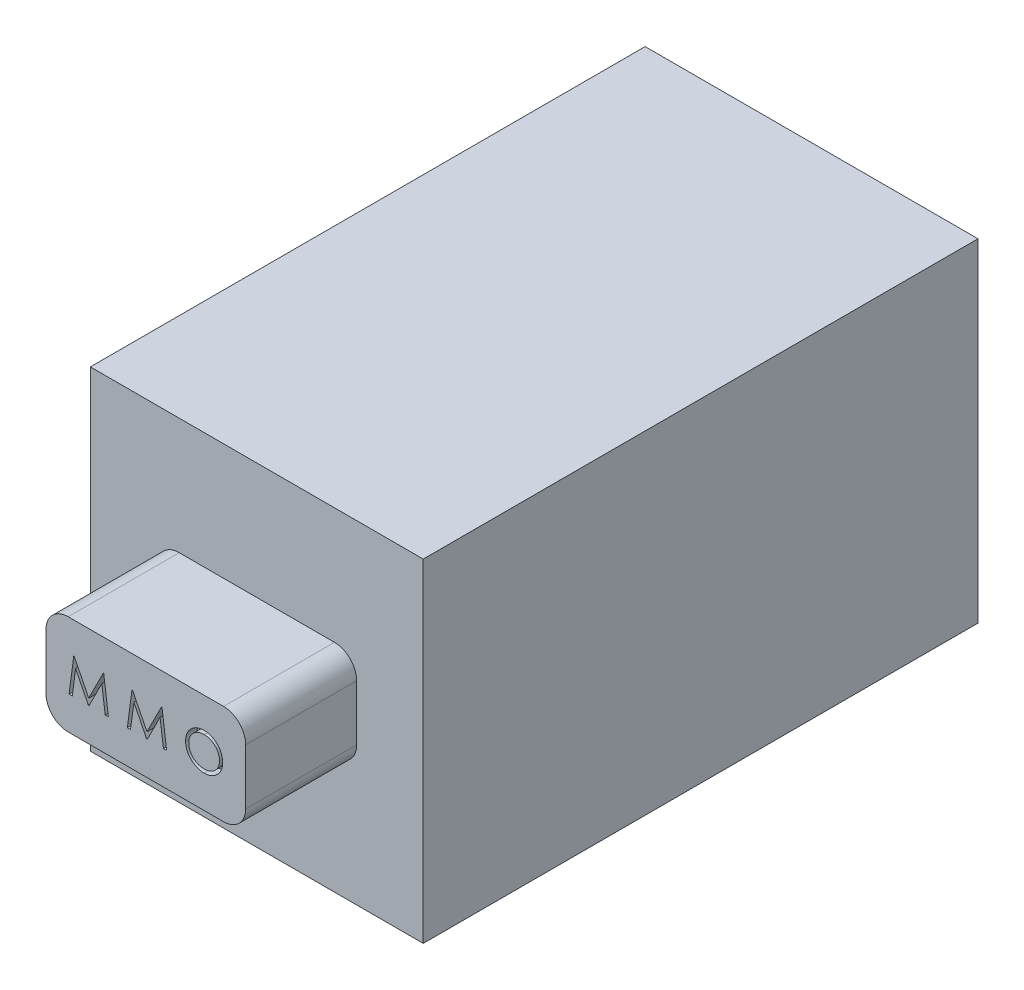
ISO-10303-21;
HEADER;
FILE_DESCRIPTION(('STEP AP214'),'2;1');
FILE_NAME('part.step','',(''),(''),'','','');
FILE_SCHEMA(('AUTOMOTIVE_DESIGN { 1 0 10303 214 1 1 1 1 }'));
ENDSEC;
DATA;
#1=APPLICATION_CONTEXT('core data for automotive mechanical design processes');
#2=APPLICATION_PROTOCOL_DEFINITION('international standard','automotive_design',2000,#1);
#3=PRODUCT_CONTEXT('',#1,'mechanical');
#4=PRODUCT('Part','Part','',(#3));
#5=PRODUCT_RELATED_PRODUCT_CATEGORY('part','',(#4));
#6=PRODUCT_DEFINITION_FORMATION('','',#4);
#7=PRODUCT_DEFINITION_CONTEXT('part definition',#1,'design');
#8=PRODUCT_DEFINITION('design','',#6,#7);
#9=PRODUCT_DEFINITION_SHAPE('','',#8);
#10=(LENGTH_UNIT() NAMED_UNIT(*) SI_UNIT(.MILLI.,.METRE.));
#11=(NAMED_UNIT(*) PLANE_ANGLE_UNIT() SI_UNIT($,.RADIAN.));
#12=(NAMED_UNIT(*) SI_UNIT($,.STERADIAN.) SOLID_ANGLE_UNIT());
#13=UNCERTAINTY_MEASURE_WITH_UNIT(LENGTH_MEASURE(1.E-05),#10,'distance_accuracy_value','');
#14=(GEOMETRIC_REPRESENTATION_CONTEXT(3) GLOBAL_UNCERTAINTY_ASSIGNED_CONTEXT((#13)) GLOBAL_UNIT_ASSIGNED_CONTEXT((#10,
#11,#12)) REPRESENTATION_CONTEXT('',''));
#15=CARTESIAN_POINT('',(0.,0.,0.));
#16=DIRECTION('',(0.,0.,1.));
#17=DIRECTION('',(1.,0.,0.));
#18=AXIS2_PLACEMENT_3D('',#15,#16,#17);
#19=CARTESIAN_POINT('',(3.5,1.25,30.));
#20=DIRECTION('',(0.,0.,-1.));
#21=DIRECTION('',(-1.,0.,0.));
#22=AXIS2_PLACEMENT_3D('',#19,#20,#21);
#23=PLANE('',#22);
#24=CARTESIAN_POINT('',(2.63565705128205,0.878205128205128,30.));
#25=CARTESIAN_POINT('',(2.60626194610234,0.877460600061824,30.));
#26=CARTESIAN_POINT('',(2.54852753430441,0.875998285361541,30.));
#27=CARTESIAN_POINT('',(2.46367570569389,0.864804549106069,30.));
#28=CARTESIAN_POINT('',(2.38267007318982,0.845439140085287,30.));
#29=CARTESIAN_POINT('',(2.3048507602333,0.819647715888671,30.));
#30=CARTESIAN_POINT('',(2.23114858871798,0.785242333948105,30.));
#31=CARTESIAN_POINT('',(2.16100880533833,0.743656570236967,30.));
#32=CARTESIAN_POINT('',(2.0945982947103,0.694454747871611,30.));
#33=CARTESIAN_POINT('',(2.03281216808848,0.63801720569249,30.));
#34=CARTESIAN_POINT('',(1.97627133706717,0.576611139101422,30.));
#35=CARTESIAN_POINT('',(1.92645745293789,0.511080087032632,30.));
#36=CARTESIAN_POINT('',(1.88470969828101,0.44182027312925,30.));
#37=CARTESIAN_POINT('',(1.85042614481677,0.369039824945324,30.));
#38=CARTESIAN_POINT('',(1.82352998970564,0.292903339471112,30.));
#39=CARTESIAN_POINT('',(1.80497028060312,0.21300491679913,30.));
#40=CARTESIAN_POINT('',(1.79311476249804,0.129862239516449,30.));
#41=CARTESIAN_POINT('',(1.79172874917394,0.0731536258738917,30.));
#42=CARTESIAN_POINT('',(1.79102564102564,0.0443860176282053,30.));
#43=B_SPLINE_CURVE_WITH_KNOTS('',3,(#24,#25,#26,#27,#28,#29,#30,#31,#32,#33,#34,#35,#36,#37,#38,
#39,#40,#41,#42),.UNSPECIFIED.,.F.,.F.,(4,1,1,1,1,1,1,1,1,1,1,1,1,1,1,1,4),(0.,
0.0665700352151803,0.130749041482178,0.193412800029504,0.254989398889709,0.3161135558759,
0.377261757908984,0.439400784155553,0.502970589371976,0.566524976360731,0.628231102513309,
0.689090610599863,0.749344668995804,0.810169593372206,0.871609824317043,0.934869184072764,1.),.UNSPECIFIED.);
#44=CARTESIAN_POINT('',(2.63565705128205,0.878205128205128,30.));
#45=VERTEX_POINT('',#44);
#46=CARTESIAN_POINT('',(1.79102564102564,0.0443860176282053,30.));
#47=VERTEX_POINT('',#46);
#48=EDGE_CURVE('E407',#45,#47,#43,.T.);
#49=ORIENTED_EDGE('',*,*,#48,.F.);
#50=CARTESIAN_POINT('',(3.4599358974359,0.0367538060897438,30.));
#51=CARTESIAN_POINT('',(3.45969340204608,0.0556371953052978,30.));
#52=CARTESIAN_POINT('',(3.45921147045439,0.0931657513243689,30.));
#53=CARTESIAN_POINT('',(3.45340952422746,0.148894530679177,30.));
#54=CARTESIAN_POINT('',(3.44499046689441,0.203727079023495,30.));
#55=CARTESIAN_POINT('',(3.43292459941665,0.257507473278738,30.));
#56=CARTESIAN_POINT('',(3.4171440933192,0.31010406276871,30.));
#57=CARTESIAN_POINT('',(3.39852406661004,0.36187958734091,30.));
#58=CARTESIAN_POINT('',(3.37578206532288,0.412309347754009,30.));
#59=CARTESIAN_POINT('',(3.35007334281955,0.461632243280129,30.));
#60=CARTESIAN_POINT('',(3.32137959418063,0.509079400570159,30.));
#61=CARTESIAN_POINT('',(3.28968595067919,0.553928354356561,30.));
#62=CARTESIAN_POINT('',(3.25610562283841,0.596555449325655,30.));
#63=CARTESIAN_POINT('',(3.21929222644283,0.63585605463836,30.));
#64=CARTESIAN_POINT('',(3.18045905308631,0.672973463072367,30.));
#65=CARTESIAN_POINT('',(3.13897614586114,0.707337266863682,30.));
#66=CARTESIAN_POINT('',(3.09509662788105,0.739257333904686,30.));
#67=CARTESIAN_POINT('',(3.04863169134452,0.768022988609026,30.));
#68=CARTESIAN_POINT('',(3.00072625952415,0.794039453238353,30.));
#69=CARTESIAN_POINT('',(2.9513428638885,0.816365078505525,30.));
#70=CARTESIAN_POINT('',(2.90115220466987,0.835526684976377,30.));
#71=CARTESIAN_POINT('',(2.84991920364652,0.851057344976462,30.));
#72=CARTESIAN_POINT('',(2.7977799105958,0.863318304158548,30.));
#73=CARTESIAN_POINT('',(2.74462052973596,0.871667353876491,30.));
#74=CARTESIAN_POINT('',(2.69048341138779,0.87748409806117,30.));
#75=CARTESIAN_POINT('',(2.65401113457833,0.877963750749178,30.));
#76=CARTESIAN_POINT('',(2.63565705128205,0.878205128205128,30.));
#77=B_SPLINE_CURVE_WITH_KNOTS('',3,(#50,#51,#52,#53,#54,#55,#56,#57,#58,#59,#60,#61,#62,#63,#64,
#65,#66,#67,#68,#69,#70,#71,#72,#73,#74,#75,#76),.UNSPECIFIED.,.F.,.F.,(4,1,1,1,1,1,1,1,1,1,1,1,
1,1,1,1,1,1,1,1,1,1,1,1,4),(0.,0.0432089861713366,0.0858728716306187,0.128120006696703,
0.170151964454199,0.211917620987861,0.253753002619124,0.296006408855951,0.338443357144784,
0.381015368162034,0.422820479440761,0.464089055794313,0.505125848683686,0.545974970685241,
0.58698521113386,0.628338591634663,0.670083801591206,0.711991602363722,0.753039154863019,
0.794049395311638,0.834885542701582,0.875498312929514,0.916547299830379,0.958003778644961,1.),.UNSPECIFIED.);
#78=CARTESIAN_POINT('',(3.4599358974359,0.0367538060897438,30.));
#79=VERTEX_POINT('',#78);
#80=EDGE_CURVE('E49',#79,#45,#77,.T.);
#81=ORIENTED_EDGE('',*,*,#80,.F.);
#82=CARTESIAN_POINT('',(2.62293669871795,-0.790705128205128,30.));
#83=CARTESIAN_POINT('',(2.65170415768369,-0.790002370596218,30.));
#84=CARTESIAN_POINT('',(2.70841247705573,-0.788617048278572,30.));
#85=CARTESIAN_POINT('',(2.79165963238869,-0.776741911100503,30.));
#86=CARTESIAN_POINT('',(2.87161418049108,-0.75817210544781,30.));
#87=CARTESIAN_POINT('',(2.94804747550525,-0.731633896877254,30.));
#88=CARTESIAN_POINT('',(3.02100214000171,-0.697336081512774,30.));
#89=CARTESIAN_POINT('',(3.09062085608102,-0.65551480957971,30.));
#90=CARTESIAN_POINT('',(3.15662418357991,-0.605890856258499,30.));
#91=CARTESIAN_POINT('',(3.21846490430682,-0.549572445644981,30.));
#92=CARTESIAN_POINT('',(3.27504757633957,-0.488262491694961,30.));
#93=CARTESIAN_POINT('',(3.32437772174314,-0.422569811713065,30.));
#94=CARTESIAN_POINT('',(3.36620839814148,-0.353783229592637,30.));
#95=CARTESIAN_POINT('',(3.40039105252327,-0.28171185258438,30.));
#96=CARTESIAN_POINT('',(3.42745314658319,-0.206704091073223,30.));
#97=CARTESIAN_POINT('',(3.44591568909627,-0.128259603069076,30.));
#98=CARTESIAN_POINT('',(3.45786092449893,-0.0468256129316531,30.));
#99=CARTESIAN_POINT('',(3.45923744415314,0.00862027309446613,30.));
#100=CARTESIAN_POINT('',(3.4599358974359,0.0367538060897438,30.));
#101=B_SPLINE_CURVE_WITH_KNOTS('',3,(#82,#83,#84,#85,#86,#87,#88,#89,#90,#91,#92,#93,#94,#95,
#96,#97,#98,#99,#100),.UNSPECIFIED.,.F.,.F.,(4,1,1,1,1,1,1,1,1,1,1,1,1,1,1,1,4),(0.,
0.0658188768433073,0.129746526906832,0.192071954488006,0.253459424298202,0.314569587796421,
0.376279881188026,0.43902565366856,0.503267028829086,0.567492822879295,0.629704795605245,
0.690999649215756,0.751451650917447,0.812004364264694,0.873149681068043,0.935635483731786,1.),.UNSPECIFIED.);
#102=CARTESIAN_POINT('',(2.62293669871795,-0.790705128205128,30.));
#103=VERTEX_POINT('',#102);
#104=EDGE_CURVE('E423',#103,#79,#101,.T.);
#105=ORIENTED_EDGE('',*,*,#104,.F.);
#106=CARTESIAN_POINT('',(1.79102564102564,0.0443860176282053,30.));
#107=CARTESIAN_POINT('',(1.79172864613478,0.0158303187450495,30.));
#108=CARTESIAN_POINT('',(1.79311435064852,-0.0404562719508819,30.));
#109=CARTESIAN_POINT('',(1.80498376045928,-0.123071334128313,30.));
#110=CARTESIAN_POINT('',(1.82359878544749,-0.202487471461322,30.));
#111=CARTESIAN_POINT('',(1.8501763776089,-0.278572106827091,30.));
#112=CARTESIAN_POINT('',(1.88429650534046,-0.351405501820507,30.));
#113=CARTESIAN_POINT('',(1.92632224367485,-0.42079601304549,30.));
#114=CARTESIAN_POINT('',(1.97582557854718,-0.486766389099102,30.));
#115=CARTESIAN_POINT('',(2.03216225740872,-0.548593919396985,30.));
#116=CARTESIAN_POINT('',(2.09357630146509,-0.605289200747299,30.));
#117=CARTESIAN_POINT('',(2.15944860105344,-0.654691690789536,30.));
#118=CARTESIAN_POINT('',(2.22829771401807,-0.69720227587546,30.));
#119=CARTESIAN_POINT('',(2.30100961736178,-0.731122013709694,30.));
#120=CARTESIAN_POINT('',(2.37661999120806,-0.758232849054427,30.));
#121=CARTESIAN_POINT('',(2.45580554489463,-0.776717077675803,30.));
#122=CARTESIAN_POINT('',(2.53819523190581,-0.788640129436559,30.));
#123=CARTESIAN_POINT('',(2.59437958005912,-0.790009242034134,30.));
#124=CARTESIAN_POINT('',(2.62293669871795,-0.790705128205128,30.));
#125=B_SPLINE_CURVE_WITH_KNOTS('',3,(#106,#107,#108,#109,#110,#111,#112,#113,#114,#115,#116,
#117,#118,#119,#120,#121,#122,#123,#124),.UNSPECIFIED.,.F.,.F.,(4,1,1,1,1,1,1,1,1,1,1,1,1,1,1,1,
4),(0.,0.0652265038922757,0.128568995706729,0.190320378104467,0.251377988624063,
0.312387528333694,0.373788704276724,0.436431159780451,0.500566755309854,0.564686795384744,
0.627135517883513,0.688455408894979,0.749245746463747,0.810155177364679,0.871670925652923,
0.934773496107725,1.),.UNSPECIFIED.);
#126=EDGE_CURVE('E415',#47,#103,#125,.T.);
#127=ORIENTED_EDGE('',*,*,#126,.F.);
#128=EDGE_LOOP('',(#49,#81,#105,#127));
#129=FACE_BOUND('',#128,.T.);
#130=CARTESIAN_POINT('',(3.5,1.25,30.));
#131=DIRECTION('',(0.,0.,1.));
#132=DIRECTION('',(-1.,0.,0.));
#133=AXIS2_PLACEMENT_3D('',#130,#131,#132);
#134=CIRCLE('',#133,1.);
#135=CARTESIAN_POINT('',(4.5,1.24999999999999,30.));
#136=VERTEX_POINT('',#135);
#137=CARTESIAN_POINT('',(3.49999999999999,2.25,30.));
#138=VERTEX_POINT('',#137);
#139=EDGE_CURVE('E651',#136,#138,#134,.T.);
#140=ORIENTED_EDGE('',*,*,#139,.T.);
#141=DIRECTION('',(-1.,0.,0.));
#142=VECTOR('',#141,1.);
#143=CARTESIAN_POINT('',(-3.49999999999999,2.25,30.));
#144=LINE('',#143,#142);
#145=CARTESIAN_POINT('',(-3.49999999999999,2.25,30.));
#146=VERTEX_POINT('',#145);
#147=EDGE_CURVE('E654',#138,#146,#144,.T.);
#148=ORIENTED_EDGE('',*,*,#147,.T.);
#149=CARTESIAN_POINT('',(-3.5,1.25,30.));
#150=DIRECTION('',(0.,0.,1.));
#151=DIRECTION('',(-1.,0.,0.));
#152=AXIS2_PLACEMENT_3D('',#149,#150,#151);
#153=CIRCLE('',#152,1.);
#154=CARTESIAN_POINT('',(-4.5,1.24999999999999,30.));
#155=VERTEX_POINT('',#154);
#156=EDGE_CURVE('E657',#146,#155,#153,.T.);
#157=ORIENTED_EDGE('',*,*,#156,.T.);
#158=DIRECTION('',(0.,-1.,0.));
#159=VECTOR('',#158,1.);
#160=CARTESIAN_POINT('',(-4.5,-1.24999999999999,30.));
#161=LINE('',#160,#159);
#162=CARTESIAN_POINT('',(-4.5,-1.24999999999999,30.));
#163=VERTEX_POINT('',#162);
#164=EDGE_CURVE('E659',#155,#163,#161,.T.);
#165=ORIENTED_EDGE('',*,*,#164,.T.);
#166=CARTESIAN_POINT('',(-3.5,-1.25,30.));
#167=DIRECTION('',(0.,0.,1.));
#168=DIRECTION('',(1.,0.,0.));
#169=AXIS2_PLACEMENT_3D('',#166,#167,#168);
#170=CIRCLE('',#169,1.);
#171=CARTESIAN_POINT('',(-3.49999999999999,-2.25,30.));
#172=VERTEX_POINT('',#171);
#173=EDGE_CURVE('E661',#163,#172,#170,.T.);
#174=ORIENTED_EDGE('',*,*,#173,.T.);
#175=DIRECTION('',(1.,0.,0.));
#176=VECTOR('',#175,1.);
#177=CARTESIAN_POINT('',(-3.49999999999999,-2.25,30.));
#178=LINE('',#177,#176);
#179=CARTESIAN_POINT('',(3.49999999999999,-2.25,30.));
#180=VERTEX_POINT('',#179);
#181=EDGE_CURVE('E663',#172,#180,#178,.T.);
#182=ORIENTED_EDGE('',*,*,#181,.T.);
#183=CARTESIAN_POINT('',(3.5,-1.25,30.));
#184=DIRECTION('',(0.,0.,1.));
#185=DIRECTION('',(-1.,0.,0.));
#186=AXIS2_PLACEMENT_3D('',#183,#184,#185);
#187=CIRCLE('',#186,1.);
#188=CARTESIAN_POINT('',(4.5,-1.24999999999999,30.));
#189=VERTEX_POINT('',#188);
#190=EDGE_CURVE('E665',#180,#189,#187,.T.);
#191=ORIENTED_EDGE('',*,*,#190,.T.);
#192=DIRECTION('',(0.,1.,0.));
#193=VECTOR('',#192,1.);
#194=CARTESIAN_POINT('',(4.5,-1.24999999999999,30.));
#195=LINE('',#194,#193);
#196=EDGE_CURVE('E667',#189,#136,#195,.T.);
#197=ORIENTED_EDGE('',*,*,#196,.T.);
#198=EDGE_LOOP('',(#140,#148,#157,#165,#174,#182,#191,#197));
#199=FACE_BOUND('',#198,.T.);
#200=DIRECTION('',(-0.130875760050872,0.991398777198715,0.));
#201=VECTOR('',#200,1.);
#202=CARTESIAN_POINT('',(-1.68926282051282,-0.75,30.));
#203=LINE('',#202,#201);
#204=CARTESIAN_POINT('',(-1.68926282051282,-0.75,30.));
#205=VERTEX_POINT('',#204);
#206=CARTESIAN_POINT('',(-1.89883062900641,0.8375,30.));
#207=VERTEX_POINT('',#206);
#208=EDGE_CURVE('E589',#205,#207,#203,.T.);
#209=ORIENTED_EDGE('',*,*,#208,.F.);
#210=DIRECTION('',(1.,0.,0.));
#211=VECTOR('',#210,1.);
#212=CARTESIAN_POINT('',(-1.83268479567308,-0.75,30.));
#213=LINE('',#212,#211);
#214=CARTESIAN_POINT('',(-1.83268479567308,-0.75,30.));
#215=VERTEX_POINT('',#214);
#216=EDGE_CURVE('E522',#215,#205,#213,.T.);
#217=ORIENTED_EDGE('',*,*,#216,.F.);
#218=DIRECTION('',(0.131351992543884,-0.991335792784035,0.));
#219=VECTOR('',#218,1.);
#220=CARTESIAN_POINT('',(-1.984375,0.394831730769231,30.));
#221=LINE('',#220,#219);
#222=CARTESIAN_POINT('',(-1.984375,0.394831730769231,30.));
#223=VERTEX_POINT('',#222);
#224=EDGE_CURVE('E551',#223,#215,#221,.T.);
#225=ORIENTED_EDGE('',*,*,#224,.F.);
#226=DIRECTION('',(0.448999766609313,0.893531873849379,0.));
#227=VECTOR('',#226,1.);
#228=CARTESIAN_POINT('',(-2.55965294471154,-0.75,30.));
#229=LINE('',#228,#227);
#230=CARTESIAN_POINT('',(-2.55965294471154,-0.75,30.));
#231=VERTEX_POINT('',#230);
#232=EDGE_CURVE('E619',#231,#223,#229,.T.);
#233=ORIENTED_EDGE('',*,*,#232,.F.);
#234=DIRECTION('',(1.,0.,0.));
#235=VECTOR('',#234,1.);
#236=CARTESIAN_POINT('',(-2.5917718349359,-0.75,30.));
#237=LINE('',#236,#235);
#238=CARTESIAN_POINT('',(-2.5917718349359,-0.75,30.));
#239=VERTEX_POINT('',#238);
#240=EDGE_CURVE('E616',#239,#231,#237,.T.);
#241=ORIENTED_EDGE('',*,*,#240,.F.);
#242=DIRECTION('',(0.44840762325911,-0.893829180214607,0.));
#243=VECTOR('',#242,1.);
#244=CARTESIAN_POINT('',(-3.16482371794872,0.392287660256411,30.));
#245=LINE('',#244,#243);
#246=CARTESIAN_POINT('',(-3.16482371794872,0.392287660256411,30.));
#247=VERTEX_POINT('',#246);
#248=EDGE_CURVE('E613',#247,#239,#245,.T.);
#249=ORIENTED_EDGE('',*,*,#248,.F.);
#250=DIRECTION('',(0.131910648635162,0.991261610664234,0.));
#251=VECTOR('',#250,1.);
#252=CARTESIAN_POINT('',(-3.31683193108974,-0.749999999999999,30.));
#253=LINE('',#252,#251);
#254=CARTESIAN_POINT('',(-3.31683193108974,-0.749999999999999,30.));
#255=VERTEX_POINT('',#254);
#256=EDGE_CURVE('E610',#255,#247,#253,.T.);
#257=ORIENTED_EDGE('',*,*,#256,.F.);
#258=DIRECTION('',(1.,0.,0.));
#259=VECTOR('',#258,1.);
#260=CARTESIAN_POINT('',(-3.4599358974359,-0.749999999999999,30.));
#261=LINE('',#260,#259);
#262=CARTESIAN_POINT('',(-3.4599358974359,-0.749999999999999,30.));
#263=VERTEX_POINT('',#262);
#264=EDGE_CURVE('E607',#263,#255,#261,.T.);
#265=ORIENTED_EDGE('',*,*,#264,.F.);
#266=DIRECTION('',(-0.131656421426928,-0.991295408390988,0.));
#267=VECTOR('',#266,1.);
#268=CARTESIAN_POINT('',(-3.2490960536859,0.837500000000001,30.));
#269=LINE('',#268,#267);
#270=CARTESIAN_POINT('',(-3.2490960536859,0.837500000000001,30.));
#271=VERTEX_POINT('',#270);
#272=EDGE_CURVE('E604',#271,#263,#269,.T.);
#273=ORIENTED_EDGE('',*,*,#272,.F.);
#274=DIRECTION('',(-1.,0.,0.));
#275=VECTOR('',#274,1.);
#276=CARTESIAN_POINT('',(-3.22842548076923,0.837500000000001,30.));
#277=LINE('',#276,#275);
#278=CARTESIAN_POINT('',(-3.22842548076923,0.837500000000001,30.));
#279=VERTEX_POINT('',#278);
#280=EDGE_CURVE('E601',#279,#271,#277,.T.);
#281=ORIENTED_EDGE('',*,*,#280,.F.);
#282=DIRECTION('',(-0.448609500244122,0.893727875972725,0.));
#283=VECTOR('',#282,1.);
#284=CARTESIAN_POINT('',(-2.57459935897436,-0.465064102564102,30.));
#285=LINE('',#284,#283);
#286=CARTESIAN_POINT('',(-2.57459935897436,-0.465064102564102,30.));
#287=VERTEX_POINT('',#286);
#288=EDGE_CURVE('E598',#287,#279,#285,.T.);
#289=ORIENTED_EDGE('',*,*,#288,.F.);
#290=DIRECTION('',(-0.449480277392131,-0.893290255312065,0.));
#291=VECTOR('',#290,1.);
#292=CARTESIAN_POINT('',(-1.91918319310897,0.8375,30.));
#293=LINE('',#292,#291);
#294=CARTESIAN_POINT('',(-1.91918319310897,0.8375,30.));
#295=VERTEX_POINT('',#294);
#296=EDGE_CURVE('E595',#295,#287,#293,.T.);
#297=ORIENTED_EDGE('',*,*,#296,.F.);
#298=DIRECTION('',(-1.,0.,0.));
#299=VECTOR('',#298,1.);
#300=CARTESIAN_POINT('',(-1.89883062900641,0.8375,30.));
#301=LINE('',#300,#299);
#302=EDGE_CURVE('E592',#207,#295,#301,.T.);
#303=ORIENTED_EDGE('',*,*,#302,.F.);
#304=EDGE_LOOP('',(#209,#217,#225,#233,#241,#249,#257,#265,#273,#281,#289,#297,#303));
#305=FACE_BOUND('',#304,.T.);
#306=DIRECTION('',(-0.130875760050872,0.991398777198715,0.));
#307=VECTOR('',#306,1.);
#308=CARTESIAN_POINT('',(0.93621794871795,-0.75,30.));
#309=LINE('',#308,#307);
#310=CARTESIAN_POINT('',(0.93621794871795,-0.75,30.));
#311=VERTEX_POINT('',#310);
#312=CARTESIAN_POINT('',(0.726650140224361,0.8375,30.));
#313=VERTEX_POINT('',#312);
#314=EDGE_CURVE('E485',#311,#313,#309,.T.);
#315=ORIENTED_EDGE('',*,*,#314,.F.);
#316=DIRECTION('',(1.,0.,0.));
#317=VECTOR('',#316,1.);
#318=CARTESIAN_POINT('',(0.792795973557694,-0.75,30.));
#319=LINE('',#318,#317);
#320=CARTESIAN_POINT('',(0.792795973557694,-0.75,30.));
#321=VERTEX_POINT('',#320);
#322=EDGE_CURVE('E437',#321,#311,#319,.T.);
#323=ORIENTED_EDGE('',*,*,#322,.F.);
#324=DIRECTION('',(0.131351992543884,-0.991335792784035,0.));
#325=VECTOR('',#324,1.);
#326=CARTESIAN_POINT('',(0.641105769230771,0.394831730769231,30.));
#327=LINE('',#326,#325);
#328=CARTESIAN_POINT('',(0.641105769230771,0.394831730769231,30.));
#329=VERTEX_POINT('',#328);
#330=EDGE_CURVE('E447',#329,#321,#327,.T.);
#331=ORIENTED_EDGE('',*,*,#330,.F.);
#332=DIRECTION('',(0.448999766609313,0.893531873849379,0.));
#333=VECTOR('',#332,1.);
#334=CARTESIAN_POINT('',(0.0658278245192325,-0.75,30.));
#335=LINE('',#334,#333);
#336=CARTESIAN_POINT('',(0.0658278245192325,-0.75,30.));
#337=VERTEX_POINT('',#336);
#338=EDGE_CURVE('E515',#337,#329,#335,.T.);
#339=ORIENTED_EDGE('',*,*,#338,.F.);
#340=DIRECTION('',(1.,0.,0.));
#341=VECTOR('',#340,1.);
#342=CARTESIAN_POINT('',(0.0337089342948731,-0.75,30.));
#343=LINE('',#342,#341);
#344=CARTESIAN_POINT('',(0.0337089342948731,-0.75,30.));
#345=VERTEX_POINT('',#344);
#346=EDGE_CURVE('E512',#345,#337,#343,.T.);
#347=ORIENTED_EDGE('',*,*,#346,.F.);
#348=DIRECTION('',(0.448407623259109,-0.893829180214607,0.));
#349=VECTOR('',#348,1.);
#350=CARTESIAN_POINT('',(-0.539342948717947,0.392287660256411,30.));
#351=LINE('',#350,#349);
#352=CARTESIAN_POINT('',(-0.539342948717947,0.392287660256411,30.));
#353=VERTEX_POINT('',#352);
#354=EDGE_CURVE('E509',#353,#345,#351,.T.);
#355=ORIENTED_EDGE('',*,*,#354,.F.);
#356=DIRECTION('',(0.131910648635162,0.991261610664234,0.));
#357=VECTOR('',#356,1.);
#358=CARTESIAN_POINT('',(-0.691351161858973,-0.75,30.));
#359=LINE('',#358,#357);
#360=CARTESIAN_POINT('',(-0.691351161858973,-0.75,30.));
#361=VERTEX_POINT('',#360);
#362=EDGE_CURVE('E506',#361,#353,#359,.T.);
#363=ORIENTED_EDGE('',*,*,#362,.F.);
#364=DIRECTION('',(1.,0.,0.));
#365=VECTOR('',#364,1.);
#366=CARTESIAN_POINT('',(-0.834455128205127,-0.75,30.));
#367=LINE('',#366,#365);
#368=CARTESIAN_POINT('',(-0.834455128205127,-0.75,30.));
#369=VERTEX_POINT('',#368);
#370=EDGE_CURVE('E503',#369,#361,#367,.T.);
#371=ORIENTED_EDGE('',*,*,#370,.F.);
#372=DIRECTION('',(-0.131656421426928,-0.991295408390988,0.));
#373=VECTOR('',#372,1.);
#374=CARTESIAN_POINT('',(-0.623615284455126,0.837500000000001,30.));
#375=LINE('',#374,#373);
#376=CARTESIAN_POINT('',(-0.623615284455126,0.837500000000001,30.));
#377=VERTEX_POINT('',#376);
#378=EDGE_CURVE('E500',#377,#369,#375,.T.);
#379=ORIENTED_EDGE('',*,*,#378,.F.);
#380=DIRECTION('',(-1.,0.,0.));
#381=VECTOR('',#380,1.);
#382=CARTESIAN_POINT('',(-0.602944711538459,0.837500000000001,30.));
#383=LINE('',#382,#381);
#384=CARTESIAN_POINT('',(-0.602944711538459,0.837500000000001,30.));
#385=VERTEX_POINT('',#384);
#386=EDGE_CURVE('E497',#385,#377,#383,.T.);
#387=ORIENTED_EDGE('',*,*,#386,.F.);
#388=DIRECTION('',(-0.448609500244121,0.893727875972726,0.));
#389=VECTOR('',#388,1.);
#390=CARTESIAN_POINT('',(0.0508814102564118,-0.465064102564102,30.));
#391=LINE('',#390,#389);
#392=CARTESIAN_POINT('',(0.0508814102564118,-0.465064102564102,30.));
#393=VERTEX_POINT('',#392);
#394=EDGE_CURVE('E494',#393,#385,#391,.T.);
#395=ORIENTED_EDGE('',*,*,#394,.F.);
#396=DIRECTION('',(-0.44948027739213,-0.893290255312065,0.));
#397=VECTOR('',#396,1.);
#398=CARTESIAN_POINT('',(0.706297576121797,0.8375,30.));
#399=LINE('',#398,#397);
#400=CARTESIAN_POINT('',(0.706297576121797,0.8375,30.));
#401=VERTEX_POINT('',#400);
#402=EDGE_CURVE('E491',#401,#393,#399,.T.);
#403=ORIENTED_EDGE('',*,*,#402,.F.);
#404=DIRECTION('',(-1.,0.,0.));
#405=VECTOR('',#404,1.);
#406=CARTESIAN_POINT('',(0.726650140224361,0.8375,30.));
#407=LINE('',#406,#405);
#408=EDGE_CURVE('E488',#313,#401,#407,.T.);
#409=ORIENTED_EDGE('',*,*,#408,.F.);
#410=EDGE_LOOP('',(#315,#323,#331,#339,#347,#355,#363,#371,#379,#387,#395,#403,#409));
#411=FACE_BOUND('',#410,.T.);
#412=ADVANCED_FACE('F34',(#129,#199,#305,#411),#23,.F.);
#413=CARTESIAN_POINT('',(0.,0.,25.));
#414=DIRECTION('',(0.,0.,-1.));
#415=DIRECTION('',(-1.,0.,0.));
#416=AXIS2_PLACEMENT_3D('',#413,#414,#415);
#417=PLANE('',#416);
#418=DIRECTION('',(0.,1.,0.));
#419=VECTOR('',#418,1.);
#420=CARTESIAN_POINT('',(7.5,-7.5,25.));
#421=LINE('',#420,#419);
#422=CARTESIAN_POINT('',(7.5,-7.5,25.));
#423=VERTEX_POINT('',#422);
#424=CARTESIAN_POINT('',(7.5,7.5,25.));
#425=VERTEX_POINT('',#424);
#426=EDGE_CURVE('E716',#423,#425,#421,.T.);
#427=ORIENTED_EDGE('',*,*,#426,.T.);
#428=DIRECTION('',(-1.,0.,0.));
#429=VECTOR('',#428,1.);
#430=CARTESIAN_POINT('',(-7.5,7.5,25.));
#431=LINE('',#430,#429);
#432=CARTESIAN_POINT('',(-7.5,7.5,25.));
#433=VERTEX_POINT('',#432);
#434=EDGE_CURVE('E719',#425,#433,#431,.T.);
#435=ORIENTED_EDGE('',*,*,#434,.T.);
#436=DIRECTION('',(0.,-1.,0.));
#437=VECTOR('',#436,1.);
#438=CARTESIAN_POINT('',(-7.5,-7.5,25.));
#439=LINE('',#438,#437);
#440=CARTESIAN_POINT('',(-7.5,-7.5,25.));
#441=VERTEX_POINT('',#440);
#442=EDGE_CURVE('E722',#433,#441,#439,.T.);
#443=ORIENTED_EDGE('',*,*,#442,.T.);
#444=DIRECTION('',(1.,0.,0.));
#445=VECTOR('',#444,1.);
#446=CARTESIAN_POINT('',(-7.5,-7.5,25.));
#447=LINE('',#446,#445);
#448=EDGE_CURVE('E724',#441,#423,#447,.T.);
#449=ORIENTED_EDGE('',*,*,#448,.T.);
#450=EDGE_LOOP('',(#427,#435,#443,#449));
#451=FACE_BOUND('',#450,.T.);
#452=CARTESIAN_POINT('',(3.5,1.25,25.));
#453=DIRECTION('',(0.,0.,1.));
#454=DIRECTION('',(-1.,0.,0.));
#455=AXIS2_PLACEMENT_3D('',#452,#453,#454);
#456=CIRCLE('',#455,1.);
#457=CARTESIAN_POINT('',(4.5,1.24999999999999,25.));
#458=VERTEX_POINT('',#457);
#459=CARTESIAN_POINT('',(3.49999999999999,2.25,25.));
#460=VERTEX_POINT('',#459);
#461=EDGE_CURVE('E626',#458,#460,#456,.T.);
#462=ORIENTED_EDGE('',*,*,#461,.F.);
#463=DIRECTION('',(0.,1.,0.));
#464=VECTOR('',#463,1.);
#465=CARTESIAN_POINT('',(4.5,-1.24999999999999,25.));
#466=LINE('',#465,#464);
#467=CARTESIAN_POINT('',(4.5,-1.24999999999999,25.));
#468=VERTEX_POINT('',#467);
#469=EDGE_CURVE('E655',#468,#458,#466,.T.);
#470=ORIENTED_EDGE('',*,*,#469,.F.);
#471=CARTESIAN_POINT('',(3.5,-1.25,25.));
#472=DIRECTION('',(0.,0.,1.));
#473=DIRECTION('',(-1.,0.,0.));
#474=AXIS2_PLACEMENT_3D('',#471,#472,#473);
#475=CIRCLE('',#474,1.);
#476=CARTESIAN_POINT('',(3.49999999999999,-2.25,25.));
#477=VERTEX_POINT('',#476);
#478=EDGE_CURVE('E687',#477,#468,#475,.T.);
#479=ORIENTED_EDGE('',*,*,#478,.F.);
#480=DIRECTION('',(1.,0.,0.));
#481=VECTOR('',#480,1.);
#482=CARTESIAN_POINT('',(-3.49999999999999,-2.25,25.));
#483=LINE('',#482,#481);
#484=CARTESIAN_POINT('',(-3.49999999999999,-2.25,25.));
#485=VERTEX_POINT('',#484);
#486=EDGE_CURVE('E684',#485,#477,#483,.T.);
#487=ORIENTED_EDGE('',*,*,#486,.F.);
#488=CARTESIAN_POINT('',(-3.5,-1.25,25.));
#489=DIRECTION('',(0.,0.,1.));
#490=DIRECTION('',(1.,0.,0.));
#491=AXIS2_PLACEMENT_3D('',#488,#489,#490);
#492=CIRCLE('',#491,1.);
#493=CARTESIAN_POINT('',(-4.5,-1.25,25.));
#494=VERTEX_POINT('',#493);
#495=EDGE_CURVE('E681',#494,#485,#492,.T.);
#496=ORIENTED_EDGE('',*,*,#495,.F.);
#497=DIRECTION('',(0.,-1.,0.));
#498=VECTOR('',#497,1.);
#499=CARTESIAN_POINT('',(-4.5,-1.24999999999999,25.));
#500=LINE('',#499,#498);
#501=CARTESIAN_POINT('',(-4.5,1.24999999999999,25.));
#502=VERTEX_POINT('',#501);
#503=EDGE_CURVE('E678',#502,#494,#500,.T.);
#504=ORIENTED_EDGE('',*,*,#503,.F.);
#505=CARTESIAN_POINT('',(-3.5,1.25,25.));
#506=DIRECTION('',(0.,0.,1.));
#507=DIRECTION('',(-1.,0.,0.));
#508=AXIS2_PLACEMENT_3D('',#505,#506,#507);
#509=CIRCLE('',#508,1.);
#510=CARTESIAN_POINT('',(-3.49999999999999,2.25,25.));
#511=VERTEX_POINT('',#510);
#512=EDGE_CURVE('E675',#511,#502,#509,.T.);
#513=ORIENTED_EDGE('',*,*,#512,.F.);
#514=DIRECTION('',(-1.,0.,0.));
#515=VECTOR('',#514,1.);
#516=CARTESIAN_POINT('',(-3.49999999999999,2.25,25.));
#517=LINE('',#516,#515);
#518=EDGE_CURVE('E672',#460,#511,#517,.T.);
#519=ORIENTED_EDGE('',*,*,#518,.F.);
#520=EDGE_LOOP('',(#462,#470,#479,#487,#496,#504,#513,#519));
#521=FACE_BOUND('',#520,.T.);
#522=ADVANCED_FACE('F758',(#451,#521),#417,.F.);
#523=CARTESIAN_POINT('',(7.5,-7.5,25.));
#524=DIRECTION('',(-1.,0.,0.));
#525=DIRECTION('',(0.,0.,1.));
#526=AXIS2_PLACEMENT_3D('',#523,#524,#525);
#527=PLANE('',#526);
#528=DIRECTION('',(0.,1.,0.));
#529=VECTOR('',#528,1.);
#530=CARTESIAN_POINT('',(7.5,-7.5,0.));
#531=LINE('',#530,#529);
#532=CARTESIAN_POINT('',(7.5,-7.5,0.));
#533=VERTEX_POINT('',#532);
#534=CARTESIAN_POINT('',(7.5,7.5,0.));
#535=VERTEX_POINT('',#534);
#536=EDGE_CURVE('E715',#533,#535,#531,.T.);
#537=ORIENTED_EDGE('',*,*,#536,.T.);
#538=DIRECTION('',(0.,0.,-1.));
#539=VECTOR('',#538,1.);
#540=CARTESIAN_POINT('',(7.5,7.5,25.));
#541=LINE('',#540,#539);
#542=EDGE_CURVE('E11',#425,#535,#541,.T.);
#543=ORIENTED_EDGE('',*,*,#542,.F.);
#544=ORIENTED_EDGE('',*,*,#426,.F.);
#545=DIRECTION('',(0.,0.,-1.));
#546=VECTOR('',#545,1.);
#547=CARTESIAN_POINT('',(7.5,-7.5,25.));
#548=LINE('',#547,#546);
#549=EDGE_CURVE('E726',#423,#533,#548,.T.);
#550=ORIENTED_EDGE('',*,*,#549,.T.);
#551=EDGE_LOOP('',(#537,#543,#544,#550));
#552=FACE_BOUND('',#551,.T.);
#553=ADVANCED_FACE('F36',(#552),#527,.F.);
#554=CARTESIAN_POINT('',(-7.5,7.5,25.));
#555=DIRECTION('',(0.,-1.,0.));
#556=DIRECTION('',(0.,0.,-1.));
#557=AXIS2_PLACEMENT_3D('',#554,#555,#556);
#558=PLANE('',#557);
#559=DIRECTION('',(-1.,0.,0.));
#560=VECTOR('',#559,1.);
#561=CARTESIAN_POINT('',(-7.5,7.5,0.));
#562=LINE('',#561,#560);
#563=CARTESIAN_POINT('',(-7.5,7.5,0.));
#564=VERTEX_POINT('',#563);
#565=EDGE_CURVE('E729',#535,#564,#562,.T.);
#566=ORIENTED_EDGE('',*,*,#565,.T.);
#567=DIRECTION('',(0.,0.,-1.));
#568=VECTOR('',#567,1.);
#569=CARTESIAN_POINT('',(-7.5,7.5,25.));
#570=LINE('',#569,#568);
#571=EDGE_CURVE('E42',#433,#564,#570,.T.);
#572=ORIENTED_EDGE('',*,*,#571,.F.);
#573=ORIENTED_EDGE('',*,*,#434,.F.);
#574=ORIENTED_EDGE('',*,*,#542,.T.);
#575=EDGE_LOOP('',(#566,#572,#573,#574));
#576=FACE_BOUND('',#575,.T.);
#577=ADVANCED_FACE('F760',(#576),#558,.F.);
#578=CARTESIAN_POINT('',(-7.5,-7.5,25.));
#579=DIRECTION('',(1.,0.,0.));
#580=DIRECTION('',(0.,0.,-1.));
#581=AXIS2_PLACEMENT_3D('',#578,#579,#580);
#582=PLANE('',#581);
#583=DIRECTION('',(0.,-1.,0.));
#584=VECTOR('',#583,1.);
#585=CARTESIAN_POINT('',(-7.5,-7.5,0.));
#586=LINE('',#585,#584);
#587=CARTESIAN_POINT('',(-7.5,-7.5,0.));
#588=VERTEX_POINT('',#587);
#589=EDGE_CURVE('E731',#564,#588,#586,.T.);
#590=ORIENTED_EDGE('',*,*,#589,.T.);
#591=DIRECTION('',(0.,0.,-1.));
#592=VECTOR('',#591,1.);
#593=CARTESIAN_POINT('',(-7.5,-7.5,25.));
#594=LINE('',#593,#592);
#595=EDGE_CURVE('E736',#441,#588,#594,.T.);
#596=ORIENTED_EDGE('',*,*,#595,.F.);
#597=ORIENTED_EDGE('',*,*,#442,.F.);
#598=ORIENTED_EDGE('',*,*,#571,.T.);
#599=EDGE_LOOP('',(#590,#596,#597,#598));
#600=FACE_BOUND('',#599,.T.);
#601=ADVANCED_FACE('F743',(#600),#582,.F.);
#602=CARTESIAN_POINT('',(-7.5,-7.5,25.));
#603=DIRECTION('',(0.,1.,0.));
#604=DIRECTION('',(0.,0.,1.));
#605=AXIS2_PLACEMENT_3D('',#602,#603,#604);
#606=PLANE('',#605);
#607=DIRECTION('',(1.,0.,0.));
#608=VECTOR('',#607,1.);
#609=CARTESIAN_POINT('',(-7.5,-7.5,0.));
#610=LINE('',#609,#608);
#611=EDGE_CURVE('E720',#588,#533,#610,.T.);
#612=ORIENTED_EDGE('',*,*,#611,.T.);
#613=ORIENTED_EDGE('',*,*,#549,.F.);
#614=ORIENTED_EDGE('',*,*,#448,.F.);
#615=ORIENTED_EDGE('',*,*,#595,.T.);
#616=EDGE_LOOP('',(#612,#613,#614,#615));
#617=FACE_BOUND('',#616,.T.);
#618=ADVANCED_FACE('F752',(#617),#606,.F.);
#619=CARTESIAN_POINT('',(0.,0.,0.));
#620=DIRECTION('',(0.,0.,-1.));
#621=DIRECTION('',(-1.,0.,0.));
#622=AXIS2_PLACEMENT_3D('',#619,#620,#621);
#623=PLANE('',#622);
#624=ORIENTED_EDGE('',*,*,#536,.F.);
#625=ORIENTED_EDGE('',*,*,#611,.F.);
#626=ORIENTED_EDGE('',*,*,#589,.F.);
#627=ORIENTED_EDGE('',*,*,#565,.F.);
#628=EDGE_LOOP('',(#624,#625,#626,#627));
#629=FACE_BOUND('',#628,.T.);
#630=ADVANCED_FACE('F749',(#629),#623,.T.);
#631=CARTESIAN_POINT('',(3.5,1.25,30.));
#632=DIRECTION('',(0.,0.,-1.));
#633=DIRECTION('',(-1.,0.,0.));
#634=AXIS2_PLACEMENT_3D('',#631,#632,#633);
#635=CYLINDRICAL_SURFACE('',#634,1.);
#636=ORIENTED_EDGE('',*,*,#461,.T.);
#637=DIRECTION('',(0.,0.,-1.));
#638=VECTOR('',#637,1.);
#639=CARTESIAN_POINT('',(3.49999999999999,2.25,30.));
#640=LINE('',#639,#638);
#641=EDGE_CURVE('E712',#138,#460,#640,.T.);
#642=ORIENTED_EDGE('',*,*,#641,.F.);
#643=ORIENTED_EDGE('',*,*,#139,.F.);
#644=DIRECTION('',(0.,0.,-1.));
#645=VECTOR('',#644,1.);
#646=CARTESIAN_POINT('',(4.5,1.24999999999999,30.));
#647=LINE('',#646,#645);
#648=EDGE_CURVE('E669',#136,#458,#647,.T.);
#649=ORIENTED_EDGE('',*,*,#648,.T.);
#650=EDGE_LOOP('',(#636,#642,#643,#649));
#651=FACE_BOUND('',#650,.T.);
#652=ADVANCED_FACE('F1024',(#651),#635,.T.);
#653=CARTESIAN_POINT('',(-3.49999999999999,2.25,30.));
#654=DIRECTION('',(0.,-1.,0.));
#655=DIRECTION('',(0.,0.,-1.));
#656=AXIS2_PLACEMENT_3D('',#653,#654,#655);
#657=PLANE('',#656);
#658=ORIENTED_EDGE('',*,*,#518,.T.);
#659=DIRECTION('',(0.,0.,-1.));
#660=VECTOR('',#659,1.);
#661=CARTESIAN_POINT('',(-3.49999999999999,2.25,30.));
#662=LINE('',#661,#660);
#663=EDGE_CURVE('E709',#146,#511,#662,.T.);
#664=ORIENTED_EDGE('',*,*,#663,.F.);
#665=ORIENTED_EDGE('',*,*,#147,.F.);
#666=ORIENTED_EDGE('',*,*,#641,.T.);
#667=EDGE_LOOP('',(#658,#664,#665,#666));
#668=FACE_BOUND('',#667,.T.);
#669=ADVANCED_FACE('F1020',(#668),#657,.F.);
#670=CARTESIAN_POINT('',(-3.5,1.25,30.));
#671=DIRECTION('',(0.,0.,-1.));
#672=DIRECTION('',(-1.,0.,0.));
#673=AXIS2_PLACEMENT_3D('',#670,#671,#672);
#674=CYLINDRICAL_SURFACE('',#673,1.);
#675=ORIENTED_EDGE('',*,*,#512,.T.);
#676=DIRECTION('',(0.,0.,-1.));
#677=VECTOR('',#676,1.);
#678=CARTESIAN_POINT('',(-4.5,1.24999999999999,30.));
#679=LINE('',#678,#677);
#680=EDGE_CURVE('E706',#155,#502,#679,.T.);
#681=ORIENTED_EDGE('',*,*,#680,.F.);
#682=ORIENTED_EDGE('',*,*,#156,.F.);
#683=ORIENTED_EDGE('',*,*,#663,.T.);
#684=EDGE_LOOP('',(#675,#681,#682,#683));
#685=FACE_BOUND('',#684,.T.);
#686=ADVANCED_FACE('F1016',(#685),#674,.T.);
#687=CARTESIAN_POINT('',(-4.5,-1.24999999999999,30.));
#688=DIRECTION('',(1.,0.,0.));
#689=DIRECTION('',(0.,0.,-1.));
#690=AXIS2_PLACEMENT_3D('',#687,#688,#689);
#691=PLANE('',#690);
#692=ORIENTED_EDGE('',*,*,#503,.T.);
#693=DIRECTION('',(0.,0.,-1.));
#694=VECTOR('',#693,1.);
#695=CARTESIAN_POINT('',(-4.5,-1.24999999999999,30.));
#696=LINE('',#695,#694);
#697=EDGE_CURVE('E703',#163,#494,#696,.T.);
#698=ORIENTED_EDGE('',*,*,#697,.F.);
#699=ORIENTED_EDGE('',*,*,#164,.F.);
#700=ORIENTED_EDGE('',*,*,#680,.T.);
#701=EDGE_LOOP('',(#692,#698,#699,#700));
#702=FACE_BOUND('',#701,.T.);
#703=ADVANCED_FACE('F1012',(#702),#691,.F.);
#704=CARTESIAN_POINT('',(-3.5,-1.25,30.));
#705=DIRECTION('',(0.,0.,-1.));
#706=DIRECTION('',(-1.,0.,0.));
#707=AXIS2_PLACEMENT_3D('',#704,#705,#706);
#708=CYLINDRICAL_SURFACE('',#707,1.);
#709=ORIENTED_EDGE('',*,*,#495,.T.);
#710=DIRECTION('',(0.,0.,-1.));
#711=VECTOR('',#710,1.);
#712=CARTESIAN_POINT('',(-3.49999999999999,-2.25,30.));
#713=LINE('',#712,#711);
#714=EDGE_CURVE('E700',#172,#485,#713,.T.);
#715=ORIENTED_EDGE('',*,*,#714,.F.);
#716=ORIENTED_EDGE('',*,*,#173,.F.);
#717=ORIENTED_EDGE('',*,*,#697,.T.);
#718=EDGE_LOOP('',(#709,#715,#716,#717));
#719=FACE_BOUND('',#718,.T.);
#720=ADVANCED_FACE('F1008',(#719),#708,.T.);
#721=CARTESIAN_POINT('',(-3.49999999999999,-2.25,30.));
#722=DIRECTION('',(0.,1.,0.));
#723=DIRECTION('',(0.,0.,1.));
#724=AXIS2_PLACEMENT_3D('',#721,#722,#723);
#725=PLANE('',#724);
#726=ORIENTED_EDGE('',*,*,#486,.T.);
#727=DIRECTION('',(0.,0.,-1.));
#728=VECTOR('',#727,1.);
#729=CARTESIAN_POINT('',(3.49999999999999,-2.25,30.));
#730=LINE('',#729,#728);
#731=EDGE_CURVE('E697',#180,#477,#730,.T.);
#732=ORIENTED_EDGE('',*,*,#731,.F.);
#733=ORIENTED_EDGE('',*,*,#181,.F.);
#734=ORIENTED_EDGE('',*,*,#714,.T.);
#735=EDGE_LOOP('',(#726,#732,#733,#734));
#736=FACE_BOUND('',#735,.T.);
#737=ADVANCED_FACE('F1002',(#736),#725,.F.);
#738=CARTESIAN_POINT('',(3.5,-1.25,30.));
#739=DIRECTION('',(0.,0.,-1.));
#740=DIRECTION('',(-1.,0.,0.));
#741=AXIS2_PLACEMENT_3D('',#738,#739,#740);
#742=CYLINDRICAL_SURFACE('',#741,1.);
#743=ORIENTED_EDGE('',*,*,#478,.T.);
#744=DIRECTION('',(0.,0.,-1.));
#745=VECTOR('',#744,1.);
#746=CARTESIAN_POINT('',(4.5,-1.24999999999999,30.));
#747=LINE('',#746,#745);
#748=EDGE_CURVE('E694',#189,#468,#747,.T.);
#749=ORIENTED_EDGE('',*,*,#748,.F.);
#750=ORIENTED_EDGE('',*,*,#190,.F.);
#751=ORIENTED_EDGE('',*,*,#731,.T.);
#752=EDGE_LOOP('',(#743,#749,#750,#751));
#753=FACE_BOUND('',#752,.T.);
#754=ADVANCED_FACE('F943',(#753),#742,.T.);
#755=CARTESIAN_POINT('',(4.5,-1.24999999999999,30.));
#756=DIRECTION('',(-1.,0.,0.));
#757=DIRECTION('',(0.,0.,1.));
#758=AXIS2_PLACEMENT_3D('',#755,#756,#757);
#759=PLANE('',#758);
#760=ORIENTED_EDGE('',*,*,#469,.T.);
#761=ORIENTED_EDGE('',*,*,#648,.F.);
#762=ORIENTED_EDGE('',*,*,#196,.F.);
#763=ORIENTED_EDGE('',*,*,#748,.T.);
#764=EDGE_LOOP('',(#760,#761,#762,#763));
#765=FACE_BOUND('',#764,.T.);
#766=ADVANCED_FACE('F938',(#765),#759,.F.);
#767=CARTESIAN_POINT('',(-1.83268479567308,-0.75,29.5));
#768=DIRECTION('',(0.,-1.,0.));
#769=DIRECTION('',(0.,0.,-1.));
#770=AXIS2_PLACEMENT_3D('',#767,#768,#769);
#771=PLANE('',#770);
#772=ORIENTED_EDGE('',*,*,#216,.T.);
#773=DIRECTION('',(0.,0.,1.));
#774=VECTOR('',#773,1.);
#775=CARTESIAN_POINT('',(-1.68926282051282,-0.75,29.5));
#776=LINE('',#775,#774);
#777=CARTESIAN_POINT('',(-1.68926282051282,-0.75,29.5));
#778=VERTEX_POINT('',#777);
#779=EDGE_CURVE('E587',#778,#205,#776,.T.);
#780=ORIENTED_EDGE('',*,*,#779,.F.);
#781=DIRECTION('',(1.,0.,0.));
#782=VECTOR('',#781,1.);
#783=CARTESIAN_POINT('',(-1.83268479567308,-0.75,29.5));
#784=LINE('',#783,#782);
#785=CARTESIAN_POINT('',(-1.83268479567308,-0.75,29.5));
#786=VERTEX_POINT('',#785);
#787=EDGE_CURVE('E547',#786,#778,#784,.T.);
#788=ORIENTED_EDGE('',*,*,#787,.F.);
#789=DIRECTION('',(0.,0.,1.));
#790=VECTOR('',#789,1.);
#791=CARTESIAN_POINT('',(-1.83268479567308,-0.75,29.5));
#792=LINE('',#791,#790);
#793=EDGE_CURVE('E624',#786,#215,#792,.T.);
#794=ORIENTED_EDGE('',*,*,#793,.T.);
#795=EDGE_LOOP('',(#772,#780,#788,#794));
#796=FACE_BOUND('',#795,.T.);
#797=ADVANCED_FACE('F894',(#796),#771,.F.);
#798=CARTESIAN_POINT('',(-1.984375,0.394831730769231,29.5));
#799=DIRECTION('',(-0.991335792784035,-0.131351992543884,0.));
#800=DIRECTION('',(0.131351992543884,-0.991335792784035,0.));
#801=AXIS2_PLACEMENT_3D('',#798,#799,#800);
#802=PLANE('',#801);
#803=ORIENTED_EDGE('',*,*,#224,.T.);
#804=ORIENTED_EDGE('',*,*,#793,.F.);
#805=DIRECTION('',(0.131351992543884,-0.991335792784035,0.));
#806=VECTOR('',#805,1.);
#807=CARTESIAN_POINT('',(-1.984375,0.394831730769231,29.5));
#808=LINE('',#807,#806);
#809=CARTESIAN_POINT('',(-1.984375,0.394831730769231,29.5));
#810=VERTEX_POINT('',#809);
#811=EDGE_CURVE('E584',#810,#786,#808,.T.);
#812=ORIENTED_EDGE('',*,*,#811,.F.);
#813=DIRECTION('',(0.,0.,1.));
#814=VECTOR('',#813,1.);
#815=CARTESIAN_POINT('',(-1.984375,0.394831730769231,29.5));
#816=LINE('',#815,#814);
#817=EDGE_CURVE('E627',#810,#223,#816,.T.);
#818=ORIENTED_EDGE('',*,*,#817,.T.);
#819=EDGE_LOOP('',(#803,#804,#812,#818));
#820=FACE_BOUND('',#819,.T.);
#821=ADVANCED_FACE('F890',(#820),#802,.F.);
#822=CARTESIAN_POINT('',(-2.55965294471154,-0.75,29.5));
#823=DIRECTION('',(0.893531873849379,-0.448999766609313,0.));
#824=DIRECTION('',(0.448999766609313,0.893531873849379,0.));
#825=AXIS2_PLACEMENT_3D('',#822,#823,#824);
#826=PLANE('',#825);
#827=ORIENTED_EDGE('',*,*,#232,.T.);
#828=ORIENTED_EDGE('',*,*,#817,.F.);
#829=DIRECTION('',(0.448999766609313,0.893531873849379,0.));
#830=VECTOR('',#829,1.);
#831=CARTESIAN_POINT('',(-2.55965294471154,-0.75,29.5));
#832=LINE('',#831,#830);
#833=CARTESIAN_POINT('',(-2.55965294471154,-0.75,29.5));
#834=VERTEX_POINT('',#833);
#835=EDGE_CURVE('E581',#834,#810,#832,.T.);
#836=ORIENTED_EDGE('',*,*,#835,.F.);
#837=DIRECTION('',(0.,0.,1.));
#838=VECTOR('',#837,1.);
#839=CARTESIAN_POINT('',(-2.55965294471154,-0.75,29.5));
#840=LINE('',#839,#838);
#841=EDGE_CURVE('E629',#834,#231,#840,.T.);
#842=ORIENTED_EDGE('',*,*,#841,.T.);
#843=EDGE_LOOP('',(#827,#828,#836,#842));
#844=FACE_BOUND('',#843,.T.);
#845=ADVANCED_FACE('F893',(#844),#826,.F.);
#846=CARTESIAN_POINT('',(-2.5917718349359,-0.75,29.5));
#847=DIRECTION('',(0.,-1.,0.));
#848=DIRECTION('',(0.,0.,-1.));
#849=AXIS2_PLACEMENT_3D('',#846,#847,#848);
#850=PLANE('',#849);
#851=ORIENTED_EDGE('',*,*,#240,.T.);
#852=ORIENTED_EDGE('',*,*,#841,.F.);
#853=DIRECTION('',(1.,0.,0.));
#854=VECTOR('',#853,1.);
#855=CARTESIAN_POINT('',(-2.5917718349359,-0.75,29.5));
#856=LINE('',#855,#854);
#857=CARTESIAN_POINT('',(-2.5917718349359,-0.75,29.5));
#858=VERTEX_POINT('',#857);
#859=EDGE_CURVE('E578',#858,#834,#856,.T.);
#860=ORIENTED_EDGE('',*,*,#859,.F.);
#861=DIRECTION('',(0.,0.,1.));
#862=VECTOR('',#861,1.);
#863=CARTESIAN_POINT('',(-2.5917718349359,-0.75,29.5));
#864=LINE('',#863,#862);
#865=EDGE_CURVE('E631',#858,#239,#864,.T.);
#866=ORIENTED_EDGE('',*,*,#865,.T.);
#867=EDGE_LOOP('',(#851,#852,#860,#866));
#868=FACE_BOUND('',#867,.T.);
#869=ADVANCED_FACE('F898',(#868),#850,.F.);
#870=CARTESIAN_POINT('',(-3.16482371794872,0.392287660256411,29.5));
#871=DIRECTION('',(-0.893829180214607,-0.44840762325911,0.));
#872=DIRECTION('',(0.44840762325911,-0.893829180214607,0.));
#873=AXIS2_PLACEMENT_3D('',#870,#871,#872);
#874=PLANE('',#873);
#875=ORIENTED_EDGE('',*,*,#248,.T.);
#876=ORIENTED_EDGE('',*,*,#865,.F.);
#877=DIRECTION('',(0.44840762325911,-0.893829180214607,0.));
#878=VECTOR('',#877,1.);
#879=CARTESIAN_POINT('',(-3.16482371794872,0.392287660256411,29.5));
#880=LINE('',#879,#878);
#881=CARTESIAN_POINT('',(-3.16482371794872,0.392287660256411,29.5));
#882=VERTEX_POINT('',#881);
#883=EDGE_CURVE('E575',#882,#858,#880,.T.);
#884=ORIENTED_EDGE('',*,*,#883,.F.);
#885=DIRECTION('',(0.,0.,1.));
#886=VECTOR('',#885,1.);
#887=CARTESIAN_POINT('',(-3.16482371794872,0.392287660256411,29.5));
#888=LINE('',#887,#886);
#889=EDGE_CURVE('E633',#882,#247,#888,.T.);
#890=ORIENTED_EDGE('',*,*,#889,.T.);
#891=EDGE_LOOP('',(#875,#876,#884,#890));
#892=FACE_BOUND('',#891,.T.);
#893=ADVANCED_FACE('F902',(#892),#874,.F.);
#894=CARTESIAN_POINT('',(-3.31683193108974,-0.749999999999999,29.5));
#895=DIRECTION('',(0.991261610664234,-0.131910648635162,0.));
#896=DIRECTION('',(0.131910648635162,0.991261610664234,0.));
#897=AXIS2_PLACEMENT_3D('',#894,#895,#896);
#898=PLANE('',#897);
#899=ORIENTED_EDGE('',*,*,#256,.T.);
#900=ORIENTED_EDGE('',*,*,#889,.F.);
#901=DIRECTION('',(0.131910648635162,0.991261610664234,0.));
#902=VECTOR('',#901,1.);
#903=CARTESIAN_POINT('',(-3.31683193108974,-0.749999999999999,29.5));
#904=LINE('',#903,#902);
#905=CARTESIAN_POINT('',(-3.31683193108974,-0.749999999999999,29.5));
#906=VERTEX_POINT('',#905);
#907=EDGE_CURVE('E572',#906,#882,#904,.T.);
#908=ORIENTED_EDGE('',*,*,#907,.F.);
#909=DIRECTION('',(0.,0.,1.));
#910=VECTOR('',#909,1.);
#911=CARTESIAN_POINT('',(-3.31683193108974,-0.749999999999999,29.5));
#912=LINE('',#911,#910);
#913=EDGE_CURVE('E635',#906,#255,#912,.T.);
#914=ORIENTED_EDGE('',*,*,#913,.T.);
#915=EDGE_LOOP('',(#899,#900,#908,#914));
#916=FACE_BOUND('',#915,.T.);
#917=ADVANCED_FACE('F906',(#916),#898,.F.);
#918=CARTESIAN_POINT('',(-3.4599358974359,-0.749999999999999,29.5));
#919=DIRECTION('',(0.,-1.,0.));
#920=DIRECTION('',(0.,0.,-1.));
#921=AXIS2_PLACEMENT_3D('',#918,#919,#920);
#922=PLANE('',#921);
#923=ORIENTED_EDGE('',*,*,#264,.T.);
#924=ORIENTED_EDGE('',*,*,#913,.F.);
#925=DIRECTION('',(1.,0.,0.));
#926=VECTOR('',#925,1.);
#927=CARTESIAN_POINT('',(-3.4599358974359,-0.749999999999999,29.5));
#928=LINE('',#927,#926);
#929=CARTESIAN_POINT('',(-3.4599358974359,-0.749999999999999,29.5));
#930=VERTEX_POINT('',#929);
#931=EDGE_CURVE('E569',#930,#906,#928,.T.);
#932=ORIENTED_EDGE('',*,*,#931,.F.);
#933=DIRECTION('',(0.,0.,1.));
#934=VECTOR('',#933,1.);
#935=CARTESIAN_POINT('',(-3.4599358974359,-0.749999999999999,29.5));
#936=LINE('',#935,#934);
#937=EDGE_CURVE('E637',#930,#263,#936,.T.);
#938=ORIENTED_EDGE('',*,*,#937,.T.);
#939=EDGE_LOOP('',(#923,#924,#932,#938));
#940=FACE_BOUND('',#939,.T.);
#941=ADVANCED_FACE('F910',(#940),#922,.F.);
#942=CARTESIAN_POINT('',(-3.2490960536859,0.837500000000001,29.5));
#943=DIRECTION('',(-0.991295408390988,0.131656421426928,0.));
#944=DIRECTION('',(-0.131656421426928,-0.991295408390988,0.));
#945=AXIS2_PLACEMENT_3D('',#942,#943,#944);
#946=PLANE('',#945);
#947=ORIENTED_EDGE('',*,*,#272,.T.);
#948=ORIENTED_EDGE('',*,*,#937,.F.);
#949=DIRECTION('',(-0.131656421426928,-0.991295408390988,0.));
#950=VECTOR('',#949,1.);
#951=CARTESIAN_POINT('',(-3.2490960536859,0.837500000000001,29.5));
#952=LINE('',#951,#950);
#953=CARTESIAN_POINT('',(-3.2490960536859,0.837500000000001,29.5));
#954=VERTEX_POINT('',#953);
#955=EDGE_CURVE('E566',#954,#930,#952,.T.);
#956=ORIENTED_EDGE('',*,*,#955,.F.);
#957=DIRECTION('',(0.,0.,1.));
#958=VECTOR('',#957,1.);
#959=CARTESIAN_POINT('',(-3.2490960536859,0.837500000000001,29.5));
#960=LINE('',#959,#958);
#961=EDGE_CURVE('E639',#954,#271,#960,.T.);
#962=ORIENTED_EDGE('',*,*,#961,.T.);
#963=EDGE_LOOP('',(#947,#948,#956,#962));
#964=FACE_BOUND('',#963,.T.);
#965=ADVANCED_FACE('F914',(#964),#946,.F.);
#966=CARTESIAN_POINT('',(-3.22842548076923,0.837500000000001,29.5));
#967=DIRECTION('',(0.,1.,0.));
#968=DIRECTION('',(0.,0.,1.));
#969=AXIS2_PLACEMENT_3D('',#966,#967,#968);
#970=PLANE('',#969);
#971=ORIENTED_EDGE('',*,*,#280,.T.);
#972=ORIENTED_EDGE('',*,*,#961,.F.);
#973=DIRECTION('',(-1.,0.,0.));
#974=VECTOR('',#973,1.);
#975=CARTESIAN_POINT('',(-3.22842548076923,0.837500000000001,29.5));
#976=LINE('',#975,#974);
#977=CARTESIAN_POINT('',(-3.22842548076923,0.837500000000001,29.5));
#978=VERTEX_POINT('',#977);
#979=EDGE_CURVE('E563',#978,#954,#976,.T.);
#980=ORIENTED_EDGE('',*,*,#979,.F.);
#981=DIRECTION('',(0.,0.,1.));
#982=VECTOR('',#981,1.);
#983=CARTESIAN_POINT('',(-3.22842548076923,0.837500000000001,29.5));
#984=LINE('',#983,#982);
#985=EDGE_CURVE('E641',#978,#279,#984,.T.);
#986=ORIENTED_EDGE('',*,*,#985,.T.);
#987=EDGE_LOOP('',(#971,#972,#980,#986));
#988=FACE_BOUND('',#987,.T.);
#989=ADVANCED_FACE('F918',(#988),#970,.F.);
#990=CARTESIAN_POINT('',(-2.57459935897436,-0.465064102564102,29.5));
#991=DIRECTION('',(0.893727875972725,0.448609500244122,0.));
#992=DIRECTION('',(-0.448609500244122,0.893727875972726,0.));
#993=AXIS2_PLACEMENT_3D('',#990,#991,#992);
#994=PLANE('',#993);
#995=ORIENTED_EDGE('',*,*,#288,.T.);
#996=ORIENTED_EDGE('',*,*,#985,.F.);
#997=DIRECTION('',(-0.448609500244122,0.893727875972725,0.));
#998=VECTOR('',#997,1.);
#999=CARTESIAN_POINT('',(-2.57459935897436,-0.465064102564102,29.5));
#1000=LINE('',#999,#998);
#1001=CARTESIAN_POINT('',(-2.57459935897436,-0.465064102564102,29.5));
#1002=VERTEX_POINT('',#1001);
#1003=EDGE_CURVE('E560',#1002,#978,#1000,.T.);
#1004=ORIENTED_EDGE('',*,*,#1003,.F.);
#1005=DIRECTION('',(0.,0.,1.));
#1006=VECTOR('',#1005,1.);
#1007=CARTESIAN_POINT('',(-2.57459935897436,-0.465064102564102,29.5));
#1008=LINE('',#1007,#1006);
#1009=EDGE_CURVE('E643',#1002,#287,#1008,.T.);
#1010=ORIENTED_EDGE('',*,*,#1009,.T.);
#1011=EDGE_LOOP('',(#995,#996,#1004,#1010));
#1012=FACE_BOUND('',#1011,.T.);
#1013=ADVANCED_FACE('F922',(#1012),#994,.F.);
#1014=CARTESIAN_POINT('',(-1.91918319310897,0.8375,29.5));
#1015=DIRECTION('',(-0.893290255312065,0.449480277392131,0.));
#1016=DIRECTION('',(-0.449480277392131,-0.893290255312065,0.));
#1017=AXIS2_PLACEMENT_3D('',#1014,#1015,#1016);
#1018=PLANE('',#1017);
#1019=ORIENTED_EDGE('',*,*,#296,.T.);
#1020=ORIENTED_EDGE('',*,*,#1009,.F.);
#1021=DIRECTION('',(-0.449480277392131,-0.893290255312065,0.));
#1022=VECTOR('',#1021,1.);
#1023=CARTESIAN_POINT('',(-1.91918319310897,0.8375,29.5));
#1024=LINE('',#1023,#1022);
#1025=CARTESIAN_POINT('',(-1.91918319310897,0.8375,29.5));
#1026=VERTEX_POINT('',#1025);
#1027=EDGE_CURVE('E557',#1026,#1002,#1024,.T.);
#1028=ORIENTED_EDGE('',*,*,#1027,.F.);
#1029=DIRECTION('',(0.,0.,1.));
#1030=VECTOR('',#1029,1.);
#1031=CARTESIAN_POINT('',(-1.91918319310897,0.8375,29.5));
#1032=LINE('',#1031,#1030);
#1033=EDGE_CURVE('E645',#1026,#295,#1032,.T.);
#1034=ORIENTED_EDGE('',*,*,#1033,.T.);
#1035=EDGE_LOOP('',(#1019,#1020,#1028,#1034));
#1036=FACE_BOUND('',#1035,.T.);
#1037=ADVANCED_FACE('F926',(#1036),#1018,.F.);
#1038=CARTESIAN_POINT('',(-1.89883062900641,0.8375,29.5));
#1039=DIRECTION('',(0.,1.,0.));
#1040=DIRECTION('',(0.,0.,1.));
#1041=AXIS2_PLACEMENT_3D('',#1038,#1039,#1040);
#1042=PLANE('',#1041);
#1043=ORIENTED_EDGE('',*,*,#302,.T.);
#1044=ORIENTED_EDGE('',*,*,#1033,.F.);
#1045=DIRECTION('',(-1.,0.,0.));
#1046=VECTOR('',#1045,1.);
#1047=CARTESIAN_POINT('',(-1.89883062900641,0.8375,29.5));
#1048=LINE('',#1047,#1046);
#1049=CARTESIAN_POINT('',(-1.89883062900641,0.8375,29.5));
#1050=VERTEX_POINT('',#1049);
#1051=EDGE_CURVE('E554',#1050,#1026,#1048,.T.);
#1052=ORIENTED_EDGE('',*,*,#1051,.F.);
#1053=DIRECTION('',(0.,0.,1.));
#1054=VECTOR('',#1053,1.);
#1055=CARTESIAN_POINT('',(-1.89883062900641,0.8375,29.5));
#1056=LINE('',#1055,#1054);
#1057=EDGE_CURVE('E647',#1050,#207,#1056,.T.);
#1058=ORIENTED_EDGE('',*,*,#1057,.T.);
#1059=EDGE_LOOP('',(#1043,#1044,#1052,#1058));
#1060=FACE_BOUND('',#1059,.T.);
#1061=ADVANCED_FACE('F930',(#1060),#1042,.F.);
#1062=CARTESIAN_POINT('',(-1.68926282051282,-0.75,29.5));
#1063=DIRECTION('',(0.991398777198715,0.130875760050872,0.));
#1064=DIRECTION('',(-0.130875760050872,0.991398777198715,0.));
#1065=AXIS2_PLACEMENT_3D('',#1062,#1063,#1064);
#1066=PLANE('',#1065);
#1067=ORIENTED_EDGE('',*,*,#208,.T.);
#1068=ORIENTED_EDGE('',*,*,#1057,.F.);
#1069=DIRECTION('',(-0.130875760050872,0.991398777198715,0.));
#1070=VECTOR('',#1069,1.);
#1071=CARTESIAN_POINT('',(-1.68926282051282,-0.75,29.5));
#1072=LINE('',#1071,#1070);
#1073=EDGE_CURVE('E550',#778,#1050,#1072,.T.);
#1074=ORIENTED_EDGE('',*,*,#1073,.F.);
#1075=ORIENTED_EDGE('',*,*,#779,.T.);
#1076=EDGE_LOOP('',(#1067,#1068,#1074,#1075));
#1077=FACE_BOUND('',#1076,.T.);
#1078=ADVANCED_FACE('F888',(#1077),#1066,.F.);
#1079=CARTESIAN_POINT('',(0.,1.96693055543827E-13,29.5));
#1080=DIRECTION('',(0.,0.,1.));
#1081=DIRECTION('',(0.,-1.,0.));
#1082=AXIS2_PLACEMENT_3D('',#1079,#1080,#1081);
#1083=PLANE('',#1082);
#1084=ORIENTED_EDGE('',*,*,#787,.T.);
#1085=ORIENTED_EDGE('',*,*,#1073,.T.);
#1086=ORIENTED_EDGE('',*,*,#1051,.T.);
#1087=ORIENTED_EDGE('',*,*,#1027,.T.);
#1088=ORIENTED_EDGE('',*,*,#1003,.T.);
#1089=ORIENTED_EDGE('',*,*,#979,.T.);
#1090=ORIENTED_EDGE('',*,*,#955,.T.);
#1091=ORIENTED_EDGE('',*,*,#931,.T.);
#1092=ORIENTED_EDGE('',*,*,#907,.T.);
#1093=ORIENTED_EDGE('',*,*,#883,.T.);
#1094=ORIENTED_EDGE('',*,*,#859,.T.);
#1095=ORIENTED_EDGE('',*,*,#835,.T.);
#1096=ORIENTED_EDGE('',*,*,#811,.T.);
#1097=EDGE_LOOP('',(#1084,#1085,#1086,#1087,#1088,#1089,#1090,#1091,#1092,#1093,#1094,#1095,#1096));
#1098=FACE_BOUND('',#1097,.T.);
#1099=ADVANCED_FACE('F884',(#1098),#1083,.T.);
#1100=CARTESIAN_POINT('',(0.792795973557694,-0.75,29.5));
#1101=DIRECTION('',(0.,-1.,0.));
#1102=DIRECTION('',(0.,0.,-1.));
#1103=AXIS2_PLACEMENT_3D('',#1100,#1101,#1102);
#1104=PLANE('',#1103);
#1105=ORIENTED_EDGE('',*,*,#322,.T.);
#1106=DIRECTION('',(0.,0.,1.));
#1107=VECTOR('',#1106,1.);
#1108=CARTESIAN_POINT('',(0.93621794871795,-0.75,29.5));
#1109=LINE('',#1108,#1107);
#1110=CARTESIAN_POINT('',(0.93621794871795,-0.75,29.5));
#1111=VERTEX_POINT('',#1110);
#1112=EDGE_CURVE('E483',#1111,#311,#1109,.T.);
#1113=ORIENTED_EDGE('',*,*,#1112,.F.);
#1114=DIRECTION('',(1.,0.,0.));
#1115=VECTOR('',#1114,1.);
#1116=CARTESIAN_POINT('',(0.792795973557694,-0.75,29.5));
#1117=LINE('',#1116,#1115);
#1118=CARTESIAN_POINT('',(0.792795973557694,-0.75,29.5));
#1119=VERTEX_POINT('',#1118);
#1120=EDGE_CURVE('E443',#1119,#1111,#1117,.T.);
#1121=ORIENTED_EDGE('',*,*,#1120,.F.);
#1122=DIRECTION('',(0.,0.,1.));
#1123=VECTOR('',#1122,1.);
#1124=CARTESIAN_POINT('',(0.792795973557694,-0.75,29.5));
#1125=LINE('',#1124,#1123);
#1126=EDGE_CURVE('E520',#1119,#321,#1125,.T.);
#1127=ORIENTED_EDGE('',*,*,#1126,.T.);
#1128=EDGE_LOOP('',(#1105,#1113,#1121,#1127));
#1129=FACE_BOUND('',#1128,.T.);
#1130=ADVANCED_FACE('F838',(#1129),#1104,.F.);
#1131=CARTESIAN_POINT('',(0.641105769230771,0.394831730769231,29.5));
#1132=DIRECTION('',(-0.991335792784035,-0.131351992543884,0.));
#1133=DIRECTION('',(0.131351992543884,-0.991335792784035,0.));
#1134=AXIS2_PLACEMENT_3D('',#1131,#1132,#1133);
#1135=PLANE('',#1134);
#1136=ORIENTED_EDGE('',*,*,#330,.T.);
#1137=ORIENTED_EDGE('',*,*,#1126,.F.);
#1138=DIRECTION('',(0.131351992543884,-0.991335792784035,0.));
#1139=VECTOR('',#1138,1.);
#1140=CARTESIAN_POINT('',(0.641105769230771,0.394831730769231,29.5));
#1141=LINE('',#1140,#1139);
#1142=CARTESIAN_POINT('',(0.641105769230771,0.394831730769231,29.5));
#1143=VERTEX_POINT('',#1142);
#1144=EDGE_CURVE('E480',#1143,#1119,#1141,.T.);
#1145=ORIENTED_EDGE('',*,*,#1144,.F.);
#1146=DIRECTION('',(0.,0.,1.));
#1147=VECTOR('',#1146,1.);
#1148=CARTESIAN_POINT('',(0.641105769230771,0.394831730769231,29.5));
#1149=LINE('',#1148,#1147);
#1150=EDGE_CURVE('E523',#1143,#329,#1149,.T.);
#1151=ORIENTED_EDGE('',*,*,#1150,.T.);
#1152=EDGE_LOOP('',(#1136,#1137,#1145,#1151));
#1153=FACE_BOUND('',#1152,.T.);
#1154=ADVANCED_FACE('F834',(#1153),#1135,.F.);
#1155=CARTESIAN_POINT('',(0.0658278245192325,-0.75,29.5));
#1156=DIRECTION('',(0.893531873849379,-0.448999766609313,0.));
#1157=DIRECTION('',(0.448999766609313,0.893531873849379,0.));
#1158=AXIS2_PLACEMENT_3D('',#1155,#1156,#1157);
#1159=PLANE('',#1158);
#1160=ORIENTED_EDGE('',*,*,#338,.T.);
#1161=ORIENTED_EDGE('',*,*,#1150,.F.);
#1162=DIRECTION('',(0.448999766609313,0.893531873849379,0.));
#1163=VECTOR('',#1162,1.);
#1164=CARTESIAN_POINT('',(0.0658278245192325,-0.75,29.5));
#1165=LINE('',#1164,#1163);
#1166=CARTESIAN_POINT('',(0.0658278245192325,-0.75,29.5));
#1167=VERTEX_POINT('',#1166);
#1168=EDGE_CURVE('E477',#1167,#1143,#1165,.T.);
#1169=ORIENTED_EDGE('',*,*,#1168,.F.);
#1170=DIRECTION('',(0.,0.,1.));
#1171=VECTOR('',#1170,1.);
#1172=CARTESIAN_POINT('',(0.0658278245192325,-0.75,29.5));
#1173=LINE('',#1172,#1171);
#1174=EDGE_CURVE('E525',#1167,#337,#1173,.T.);
#1175=ORIENTED_EDGE('',*,*,#1174,.T.);
#1176=EDGE_LOOP('',(#1160,#1161,#1169,#1175));
#1177=FACE_BOUND('',#1176,.T.);
#1178=ADVANCED_FACE('F837',(#1177),#1159,.F.);
#1179=CARTESIAN_POINT('',(0.0337089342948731,-0.75,29.5));
#1180=DIRECTION('',(0.,-1.,0.));
#1181=DIRECTION('',(0.,0.,-1.));
#1182=AXIS2_PLACEMENT_3D('',#1179,#1180,#1181);
#1183=PLANE('',#1182);
#1184=ORIENTED_EDGE('',*,*,#346,.T.);
#1185=ORIENTED_EDGE('',*,*,#1174,.F.);
#1186=DIRECTION('',(1.,0.,0.));
#1187=VECTOR('',#1186,1.);
#1188=CARTESIAN_POINT('',(0.0337089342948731,-0.75,29.5));
#1189=LINE('',#1188,#1187);
#1190=CARTESIAN_POINT('',(0.0337089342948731,-0.75,29.5));
#1191=VERTEX_POINT('',#1190);
#1192=EDGE_CURVE('E474',#1191,#1167,#1189,.T.);
#1193=ORIENTED_EDGE('',*,*,#1192,.F.);
#1194=DIRECTION('',(0.,0.,1.));
#1195=VECTOR('',#1194,1.);
#1196=CARTESIAN_POINT('',(0.0337089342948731,-0.75,29.5));
#1197=LINE('',#1196,#1195);
#1198=EDGE_CURVE('E527',#1191,#345,#1197,.T.);
#1199=ORIENTED_EDGE('',*,*,#1198,.T.);
#1200=EDGE_LOOP('',(#1184,#1185,#1193,#1199));
#1201=FACE_BOUND('',#1200,.T.);
#1202=ADVANCED_FACE('F842',(#1201),#1183,.F.);
#1203=CARTESIAN_POINT('',(-0.539342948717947,0.392287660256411,29.5));
#1204=DIRECTION('',(-0.893829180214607,-0.448407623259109,0.));
#1205=DIRECTION('',(0.448407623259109,-0.893829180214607,0.));
#1206=AXIS2_PLACEMENT_3D('',#1203,#1204,#1205);
#1207=PLANE('',#1206);
#1208=ORIENTED_EDGE('',*,*,#354,.T.);
#1209=ORIENTED_EDGE('',*,*,#1198,.F.);
#1210=DIRECTION('',(0.448407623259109,-0.893829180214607,0.));
#1211=VECTOR('',#1210,1.);
#1212=CARTESIAN_POINT('',(-0.539342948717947,0.392287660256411,29.5));
#1213=LINE('',#1212,#1211);
#1214=CARTESIAN_POINT('',(-0.539342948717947,0.392287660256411,29.5));
#1215=VERTEX_POINT('',#1214);
#1216=EDGE_CURVE('E471',#1215,#1191,#1213,.T.);
#1217=ORIENTED_EDGE('',*,*,#1216,.F.);
#1218=DIRECTION('',(0.,0.,1.));
#1219=VECTOR('',#1218,1.);
#1220=CARTESIAN_POINT('',(-0.539342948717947,0.392287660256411,29.5));
#1221=LINE('',#1220,#1219);
#1222=EDGE_CURVE('E529',#1215,#353,#1221,.T.);
#1223=ORIENTED_EDGE('',*,*,#1222,.T.);
#1224=EDGE_LOOP('',(#1208,#1209,#1217,#1223));
#1225=FACE_BOUND('',#1224,.T.);
#1226=ADVANCED_FACE('F846',(#1225),#1207,.F.);
#1227=CARTESIAN_POINT('',(-0.691351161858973,-0.75,29.5));
#1228=DIRECTION('',(0.991261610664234,-0.131910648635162,0.));
#1229=DIRECTION('',(0.131910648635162,0.991261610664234,0.));
#1230=AXIS2_PLACEMENT_3D('',#1227,#1228,#1229);
#1231=PLANE('',#1230);
#1232=ORIENTED_EDGE('',*,*,#362,.T.);
#1233=ORIENTED_EDGE('',*,*,#1222,.F.);
#1234=DIRECTION('',(0.131910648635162,0.991261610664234,0.));
#1235=VECTOR('',#1234,1.);
#1236=CARTESIAN_POINT('',(-0.691351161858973,-0.75,29.5));
#1237=LINE('',#1236,#1235);
#1238=CARTESIAN_POINT('',(-0.691351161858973,-0.75,29.5));
#1239=VERTEX_POINT('',#1238);
#1240=EDGE_CURVE('E468',#1239,#1215,#1237,.T.);
#1241=ORIENTED_EDGE('',*,*,#1240,.F.);
#1242=DIRECTION('',(0.,0.,1.));
#1243=VECTOR('',#1242,1.);
#1244=CARTESIAN_POINT('',(-0.691351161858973,-0.75,29.5));
#1245=LINE('',#1244,#1243);
#1246=EDGE_CURVE('E531',#1239,#361,#1245,.T.);
#1247=ORIENTED_EDGE('',*,*,#1246,.T.);
#1248=EDGE_LOOP('',(#1232,#1233,#1241,#1247));
#1249=FACE_BOUND('',#1248,.T.);
#1250=ADVANCED_FACE('F850',(#1249),#1231,.F.);
#1251=CARTESIAN_POINT('',(-0.834455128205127,-0.75,29.5));
#1252=DIRECTION('',(0.,-1.,0.));
#1253=DIRECTION('',(0.,0.,-1.));
#1254=AXIS2_PLACEMENT_3D('',#1251,#1252,#1253);
#1255=PLANE('',#1254);
#1256=ORIENTED_EDGE('',*,*,#370,.T.);
#1257=ORIENTED_EDGE('',*,*,#1246,.F.);
#1258=DIRECTION('',(1.,0.,0.));
#1259=VECTOR('',#1258,1.);
#1260=CARTESIAN_POINT('',(-0.834455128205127,-0.75,29.5));
#1261=LINE('',#1260,#1259);
#1262=CARTESIAN_POINT('',(-0.834455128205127,-0.75,29.5));
#1263=VERTEX_POINT('',#1262);
#1264=EDGE_CURVE('E465',#1263,#1239,#1261,.T.);
#1265=ORIENTED_EDGE('',*,*,#1264,.F.);
#1266=DIRECTION('',(0.,0.,1.));
#1267=VECTOR('',#1266,1.);
#1268=CARTESIAN_POINT('',(-0.834455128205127,-0.75,29.5));
#1269=LINE('',#1268,#1267);
#1270=EDGE_CURVE('E533',#1263,#369,#1269,.T.);
#1271=ORIENTED_EDGE('',*,*,#1270,.T.);
#1272=EDGE_LOOP('',(#1256,#1257,#1265,#1271));
#1273=FACE_BOUND('',#1272,.T.);
#1274=ADVANCED_FACE('F854',(#1273),#1255,.F.);
#1275=CARTESIAN_POINT('',(-0.623615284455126,0.837500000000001,29.5));
#1276=DIRECTION('',(-0.991295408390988,0.131656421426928,0.));
#1277=DIRECTION('',(-0.131656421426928,-0.991295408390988,0.));
#1278=AXIS2_PLACEMENT_3D('',#1275,#1276,#1277);
#1279=PLANE('',#1278);
#1280=ORIENTED_EDGE('',*,*,#378,.T.);
#1281=ORIENTED_EDGE('',*,*,#1270,.F.);
#1282=DIRECTION('',(-0.131656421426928,-0.991295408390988,0.));
#1283=VECTOR('',#1282,1.);
#1284=CARTESIAN_POINT('',(-0.623615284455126,0.837500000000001,29.5));
#1285=LINE('',#1284,#1283);
#1286=CARTESIAN_POINT('',(-0.623615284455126,0.837500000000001,29.5));
#1287=VERTEX_POINT('',#1286);
#1288=EDGE_CURVE('E462',#1287,#1263,#1285,.T.);
#1289=ORIENTED_EDGE('',*,*,#1288,.F.);
#1290=DIRECTION('',(0.,0.,1.));
#1291=VECTOR('',#1290,1.);
#1292=CARTESIAN_POINT('',(-0.623615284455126,0.837500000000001,29.5));
#1293=LINE('',#1292,#1291);
#1294=EDGE_CURVE('E535',#1287,#377,#1293,.T.);
#1295=ORIENTED_EDGE('',*,*,#1294,.T.);
#1296=EDGE_LOOP('',(#1280,#1281,#1289,#1295));
#1297=FACE_BOUND('',#1296,.T.);
#1298=ADVANCED_FACE('F858',(#1297),#1279,.F.);
#1299=CARTESIAN_POINT('',(-0.602944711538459,0.837500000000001,29.5));
#1300=DIRECTION('',(0.,1.,0.));
#1301=DIRECTION('',(0.,0.,1.));
#1302=AXIS2_PLACEMENT_3D('',#1299,#1300,#1301);
#1303=PLANE('',#1302);
#1304=ORIENTED_EDGE('',*,*,#386,.T.);
#1305=ORIENTED_EDGE('',*,*,#1294,.F.);
#1306=DIRECTION('',(-1.,0.,0.));
#1307=VECTOR('',#1306,1.);
#1308=CARTESIAN_POINT('',(-0.602944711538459,0.837500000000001,29.5));
#1309=LINE('',#1308,#1307);
#1310=CARTESIAN_POINT('',(-0.602944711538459,0.837500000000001,29.5));
#1311=VERTEX_POINT('',#1310);
#1312=EDGE_CURVE('E459',#1311,#1287,#1309,.T.);
#1313=ORIENTED_EDGE('',*,*,#1312,.F.);
#1314=DIRECTION('',(0.,0.,1.));
#1315=VECTOR('',#1314,1.);
#1316=CARTESIAN_POINT('',(-0.602944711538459,0.837500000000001,29.5));
#1317=LINE('',#1316,#1315);
#1318=EDGE_CURVE('E537',#1311,#385,#1317,.T.);
#1319=ORIENTED_EDGE('',*,*,#1318,.T.);
#1320=EDGE_LOOP('',(#1304,#1305,#1313,#1319));
#1321=FACE_BOUND('',#1320,.T.);
#1322=ADVANCED_FACE('F862',(#1321),#1303,.F.);
#1323=CARTESIAN_POINT('',(0.0508814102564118,-0.465064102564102,29.5));
#1324=DIRECTION('',(0.893727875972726,0.448609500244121,0.));
#1325=DIRECTION('',(-0.448609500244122,0.893727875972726,0.));
#1326=AXIS2_PLACEMENT_3D('',#1323,#1324,#1325);
#1327=PLANE('',#1326);
#1328=ORIENTED_EDGE('',*,*,#394,.T.);
#1329=ORIENTED_EDGE('',*,*,#1318,.F.);
#1330=DIRECTION('',(-0.448609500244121,0.893727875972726,0.));
#1331=VECTOR('',#1330,1.);
#1332=CARTESIAN_POINT('',(0.0508814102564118,-0.465064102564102,29.5));
#1333=LINE('',#1332,#1331);
#1334=CARTESIAN_POINT('',(0.0508814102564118,-0.465064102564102,29.5));
#1335=VERTEX_POINT('',#1334);
#1336=EDGE_CURVE('E456',#1335,#1311,#1333,.T.);
#1337=ORIENTED_EDGE('',*,*,#1336,.F.);
#1338=DIRECTION('',(0.,0.,1.));
#1339=VECTOR('',#1338,1.);
#1340=CARTESIAN_POINT('',(0.0508814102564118,-0.465064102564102,29.5));
#1341=LINE('',#1340,#1339);
#1342=EDGE_CURVE('E539',#1335,#393,#1341,.T.);
#1343=ORIENTED_EDGE('',*,*,#1342,.T.);
#1344=EDGE_LOOP('',(#1328,#1329,#1337,#1343));
#1345=FACE_BOUND('',#1344,.T.);
#1346=ADVANCED_FACE('F866',(#1345),#1327,.F.);
#1347=CARTESIAN_POINT('',(0.706297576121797,0.8375,29.5));
#1348=DIRECTION('',(-0.893290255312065,0.44948027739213,0.));
#1349=DIRECTION('',(-0.44948027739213,-0.893290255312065,0.));
#1350=AXIS2_PLACEMENT_3D('',#1347,#1348,#1349);
#1351=PLANE('',#1350);
#1352=ORIENTED_EDGE('',*,*,#402,.T.);
#1353=ORIENTED_EDGE('',*,*,#1342,.F.);
#1354=DIRECTION('',(-0.44948027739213,-0.893290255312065,0.));
#1355=VECTOR('',#1354,1.);
#1356=CARTESIAN_POINT('',(0.706297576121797,0.8375,29.5));
#1357=LINE('',#1356,#1355);
#1358=CARTESIAN_POINT('',(0.706297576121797,0.8375,29.5));
#1359=VERTEX_POINT('',#1358);
#1360=EDGE_CURVE('E453',#1359,#1335,#1357,.T.);
#1361=ORIENTED_EDGE('',*,*,#1360,.F.);
#1362=DIRECTION('',(0.,0.,1.));
#1363=VECTOR('',#1362,1.);
#1364=CARTESIAN_POINT('',(0.706297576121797,0.8375,29.5));
#1365=LINE('',#1364,#1363);
#1366=EDGE_CURVE('E541',#1359,#401,#1365,.T.);
#1367=ORIENTED_EDGE('',*,*,#1366,.T.);
#1368=EDGE_LOOP('',(#1352,#1353,#1361,#1367));
#1369=FACE_BOUND('',#1368,.T.);
#1370=ADVANCED_FACE('F870',(#1369),#1351,.F.);
#1371=CARTESIAN_POINT('',(0.726650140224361,0.8375,29.5));
#1372=DIRECTION('',(0.,1.,0.));
#1373=DIRECTION('',(0.,0.,1.));
#1374=AXIS2_PLACEMENT_3D('',#1371,#1372,#1373);
#1375=PLANE('',#1374);
#1376=ORIENTED_EDGE('',*,*,#408,.T.);
#1377=ORIENTED_EDGE('',*,*,#1366,.F.);
#1378=DIRECTION('',(-1.,0.,0.));
#1379=VECTOR('',#1378,1.);
#1380=CARTESIAN_POINT('',(0.726650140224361,0.8375,29.5));
#1381=LINE('',#1380,#1379);
#1382=CARTESIAN_POINT('',(0.726650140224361,0.8375,29.5));
#1383=VERTEX_POINT('',#1382);
#1384=EDGE_CURVE('E450',#1383,#1359,#1381,.T.);
#1385=ORIENTED_EDGE('',*,*,#1384,.F.);
#1386=DIRECTION('',(0.,0.,1.));
#1387=VECTOR('',#1386,1.);
#1388=CARTESIAN_POINT('',(0.726650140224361,0.8375,29.5));
#1389=LINE('',#1388,#1387);
#1390=EDGE_CURVE('E543',#1383,#313,#1389,.T.);
#1391=ORIENTED_EDGE('',*,*,#1390,.T.);
#1392=EDGE_LOOP('',(#1376,#1377,#1385,#1391));
#1393=FACE_BOUND('',#1392,.T.);
#1394=ADVANCED_FACE('F874',(#1393),#1375,.F.);
#1395=CARTESIAN_POINT('',(0.93621794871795,-0.75,29.5));
#1396=DIRECTION('',(0.991398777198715,0.130875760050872,0.));
#1397=DIRECTION('',(-0.130875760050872,0.991398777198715,0.));
#1398=AXIS2_PLACEMENT_3D('',#1395,#1396,#1397);
#1399=PLANE('',#1398);
#1400=ORIENTED_EDGE('',*,*,#314,.T.);
#1401=ORIENTED_EDGE('',*,*,#1390,.F.);
#1402=DIRECTION('',(-0.130875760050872,0.991398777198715,0.));
#1403=VECTOR('',#1402,1.);
#1404=CARTESIAN_POINT('',(0.93621794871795,-0.75,29.5));
#1405=LINE('',#1404,#1403);
#1406=EDGE_CURVE('E446',#1111,#1383,#1405,.T.);
#1407=ORIENTED_EDGE('',*,*,#1406,.F.);
#1408=ORIENTED_EDGE('',*,*,#1112,.T.);
#1409=EDGE_LOOP('',(#1400,#1401,#1407,#1408));
#1410=FACE_BOUND('',#1409,.T.);
#1411=ADVANCED_FACE('F832',(#1410),#1399,.F.);
#1412=CARTESIAN_POINT('',(0.,1.96693055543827E-13,29.5));
#1413=DIRECTION('',(0.,0.,1.));
#1414=DIRECTION('',(0.,-1.,0.));
#1415=AXIS2_PLACEMENT_3D('',#1412,#1413,#1414);
#1416=PLANE('',#1415);
#1417=ORIENTED_EDGE('',*,*,#1120,.T.);
#1418=ORIENTED_EDGE('',*,*,#1406,.T.);
#1419=ORIENTED_EDGE('',*,*,#1384,.T.);
#1420=ORIENTED_EDGE('',*,*,#1360,.T.);
#1421=ORIENTED_EDGE('',*,*,#1336,.T.);
#1422=ORIENTED_EDGE('',*,*,#1312,.T.);
#1423=ORIENTED_EDGE('',*,*,#1288,.T.);
#1424=ORIENTED_EDGE('',*,*,#1264,.T.);
#1425=ORIENTED_EDGE('',*,*,#1240,.T.);
#1426=ORIENTED_EDGE('',*,*,#1216,.T.);
#1427=ORIENTED_EDGE('',*,*,#1192,.T.);
#1428=ORIENTED_EDGE('',*,*,#1168,.T.);
#1429=ORIENTED_EDGE('',*,*,#1144,.T.);
#1430=EDGE_LOOP('',(#1417,#1418,#1419,#1420,#1421,#1422,#1423,#1424,#1425,#1426,#1427,#1428,#1429));
#1431=FACE_BOUND('',#1430,.T.);
#1432=ADVANCED_FACE('F379',(#1431),#1416,.T.);
#1433=CARTESIAN_POINT('',(3.22359650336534,0.630772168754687,29.5));
#1434=DIRECTION('',(-9.46586313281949E-12,-4.8901825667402E-13,-1.));
#1435=DIRECTION('',(-1.,0.,9.46586313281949E-12));
#1436=AXIS2_PLACEMENT_3D('',#1433,#1434,#1435);
#1437=PLANE('',#1436);
#1438=CARTESIAN_POINT('',(3.4599358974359,0.0367538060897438,29.5));
#1439=CARTESIAN_POINT('',(3.45969340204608,0.0556371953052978,29.5));
#1440=CARTESIAN_POINT('',(3.45921147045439,0.0931657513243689,29.5));
#1441=CARTESIAN_POINT('',(3.45340952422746,0.148894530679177,29.5));
#1442=CARTESIAN_POINT('',(3.44499046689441,0.203727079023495,29.5));
#1443=CARTESIAN_POINT('',(3.43292459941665,0.257507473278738,29.5));
#1444=CARTESIAN_POINT('',(3.4171440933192,0.31010406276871,29.5));
#1445=CARTESIAN_POINT('',(3.39852406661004,0.36187958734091,29.5));
#1446=CARTESIAN_POINT('',(3.37578206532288,0.412309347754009,29.5));
#1447=CARTESIAN_POINT('',(3.35007334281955,0.461632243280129,29.5));
#1448=CARTESIAN_POINT('',(3.32137959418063,0.509079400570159,29.5));
#1449=CARTESIAN_POINT('',(3.28968595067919,0.553928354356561,29.5));
#1450=CARTESIAN_POINT('',(3.25610562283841,0.596555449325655,29.5));
#1451=CARTESIAN_POINT('',(3.21929222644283,0.63585605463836,29.5));
#1452=CARTESIAN_POINT('',(3.18045905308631,0.672973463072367,29.5));
#1453=CARTESIAN_POINT('',(3.13897614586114,0.707337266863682,29.5));
#1454=CARTESIAN_POINT('',(3.09509662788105,0.739257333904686,29.5));
#1455=CARTESIAN_POINT('',(3.04863169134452,0.768022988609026,29.5));
#1456=CARTESIAN_POINT('',(3.00072625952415,0.794039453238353,29.5));
#1457=CARTESIAN_POINT('',(2.9513428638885,0.816365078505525,29.5));
#1458=CARTESIAN_POINT('',(2.90115220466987,0.835526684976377,29.5));
#1459=CARTESIAN_POINT('',(2.84991920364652,0.851057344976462,29.5));
#1460=CARTESIAN_POINT('',(2.7977799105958,0.863318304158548,29.5));
#1461=CARTESIAN_POINT('',(2.74462052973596,0.871667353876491,29.5));
#1462=CARTESIAN_POINT('',(2.69048341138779,0.87748409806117,29.5));
#1463=CARTESIAN_POINT('',(2.65401113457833,0.877963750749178,29.5));
#1464=CARTESIAN_POINT('',(2.63565705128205,0.878205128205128,29.5));
#1465=B_SPLINE_CURVE_WITH_KNOTS('',3,(#1438,#1439,#1440,#1441,#1442,#1443,#1444,#1445,#1446,
#1447,#1448,#1449,#1450,#1451,#1452,#1453,#1454,#1455,#1456,#1457,#1458,#1459,#1460,#1461,#1462,
#1463,#1464),.UNSPECIFIED.,.F.,.F.,(4,1,1,1,1,1,1,1,1,1,1,1,1,1,1,1,1,1,1,1,1,1,1,1,4),(0.,
0.0432089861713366,0.0858728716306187,0.128120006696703,0.170151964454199,0.211917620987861,
0.253753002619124,0.296006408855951,0.338443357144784,0.381015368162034,0.422820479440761,
0.464089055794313,0.505125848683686,0.545974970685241,0.58698521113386,0.628338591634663,
0.670083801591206,0.711991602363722,0.753039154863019,0.794049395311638,0.834885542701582,
0.875498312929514,0.916547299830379,0.958003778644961,1.),.UNSPECIFIED.);
#1466=CARTESIAN_POINT('',(3.4599358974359,0.0367538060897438,29.5));
#1467=VERTEX_POINT('',#1466);
#1468=CARTESIAN_POINT('',(2.63565705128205,0.878205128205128,29.5));
#1469=VERTEX_POINT('',#1468);
#1470=EDGE_CURVE('E431',#1467,#1469,#1465,.T.);
#1471=ORIENTED_EDGE('',*,*,#1470,.T.);
#1472=CARTESIAN_POINT('',(2.63565705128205,0.878205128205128,29.5));
#1473=CARTESIAN_POINT('',(2.60626194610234,0.877460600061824,29.5));
#1474=CARTESIAN_POINT('',(2.54852753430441,0.875998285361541,29.5));
#1475=CARTESIAN_POINT('',(2.46367570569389,0.864804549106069,29.5));
#1476=CARTESIAN_POINT('',(2.38267007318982,0.845439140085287,29.5));
#1477=CARTESIAN_POINT('',(2.3048507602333,0.819647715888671,29.5));
#1478=CARTESIAN_POINT('',(2.23114858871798,0.785242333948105,29.5));
#1479=CARTESIAN_POINT('',(2.16100880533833,0.743656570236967,29.5));
#1480=CARTESIAN_POINT('',(2.0945982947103,0.694454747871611,29.5));
#1481=CARTESIAN_POINT('',(2.03281216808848,0.63801720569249,29.5));
#1482=CARTESIAN_POINT('',(1.97627133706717,0.576611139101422,29.5));
#1483=CARTESIAN_POINT('',(1.92645745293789,0.511080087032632,29.5));
#1484=CARTESIAN_POINT('',(1.88470969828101,0.44182027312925,29.5));
#1485=CARTESIAN_POINT('',(1.85042614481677,0.369039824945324,29.5));
#1486=CARTESIAN_POINT('',(1.82352998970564,0.292903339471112,29.5));
#1487=CARTESIAN_POINT('',(1.80497028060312,0.21300491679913,29.5));
#1488=CARTESIAN_POINT('',(1.79311476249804,0.129862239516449,29.5));
#1489=CARTESIAN_POINT('',(1.79172874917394,0.0731536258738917,29.5));
#1490=CARTESIAN_POINT('',(1.79102564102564,0.0443860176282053,29.5));
#1491=B_SPLINE_CURVE_WITH_KNOTS('',3,(#1472,#1473,#1474,#1475,#1476,#1477,#1478,#1479,#1480,
#1481,#1482,#1483,#1484,#1485,#1486,#1487,#1488,#1489,#1490),.UNSPECIFIED.,.F.,.F.,(4,1,1,1,1,1,
1,1,1,1,1,1,1,1,1,1,4),(0.,0.0665700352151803,0.130749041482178,0.193412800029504,
0.254989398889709,0.3161135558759,0.377261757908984,0.439400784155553,0.502970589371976,
0.566524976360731,0.628231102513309,0.689090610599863,0.749344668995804,0.810169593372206,
0.871609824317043,0.934869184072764,1.),.UNSPECIFIED.);
#1492=CARTESIAN_POINT('',(1.79102564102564,0.0443860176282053,29.5));
#1493=VERTEX_POINT('',#1492);
#1494=EDGE_CURVE('E820',#1469,#1493,#1491,.T.);
#1495=ORIENTED_EDGE('',*,*,#1494,.T.);
#1496=CARTESIAN_POINT('',(1.79102564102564,0.0443860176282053,29.5));
#1497=CARTESIAN_POINT('',(1.79172864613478,0.0158303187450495,29.5));
#1498=CARTESIAN_POINT('',(1.79311435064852,-0.0404562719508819,29.5));
#1499=CARTESIAN_POINT('',(1.80498376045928,-0.123071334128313,29.5));
#1500=CARTESIAN_POINT('',(1.82359878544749,-0.202487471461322,29.5));
#1501=CARTESIAN_POINT('',(1.8501763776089,-0.278572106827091,29.5));
#1502=CARTESIAN_POINT('',(1.88429650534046,-0.351405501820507,29.5));
#1503=CARTESIAN_POINT('',(1.92632224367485,-0.42079601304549,29.5));
#1504=CARTESIAN_POINT('',(1.97582557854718,-0.486766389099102,29.5));
#1505=CARTESIAN_POINT('',(2.03216225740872,-0.548593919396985,29.5));
#1506=CARTESIAN_POINT('',(2.09357630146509,-0.605289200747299,29.5));
#1507=CARTESIAN_POINT('',(2.15944860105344,-0.654691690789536,29.5));
#1508=CARTESIAN_POINT('',(2.22829771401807,-0.69720227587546,29.5));
#1509=CARTESIAN_POINT('',(2.30100961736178,-0.731122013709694,29.5));
#1510=CARTESIAN_POINT('',(2.37661999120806,-0.758232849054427,29.5));
#1511=CARTESIAN_POINT('',(2.45580554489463,-0.776717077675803,29.5));
#1512=CARTESIAN_POINT('',(2.53819523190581,-0.788640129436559,29.5));
#1513=CARTESIAN_POINT('',(2.59437958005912,-0.790009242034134,29.5));
#1514=CARTESIAN_POINT('',(2.62293669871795,-0.790705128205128,29.5));
#1515=B_SPLINE_CURVE_WITH_KNOTS('',3,(#1496,#1497,#1498,#1499,#1500,#1501,#1502,#1503,#1504,
#1505,#1506,#1507,#1508,#1509,#1510,#1511,#1512,#1513,#1514),.UNSPECIFIED.,.F.,.F.,(4,1,1,1,1,1,
1,1,1,1,1,1,1,1,1,1,4),(0.,0.0652265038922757,0.128568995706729,0.190320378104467,
0.251377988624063,0.312387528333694,0.373788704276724,0.436431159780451,0.500566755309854,
0.564686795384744,0.627135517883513,0.688455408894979,0.749245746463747,0.810155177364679,
0.871670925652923,0.934773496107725,1.),.UNSPECIFIED.);
#1516=CARTESIAN_POINT('',(2.62293669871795,-0.790705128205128,29.5));
#1517=VERTEX_POINT('',#1516);
#1518=EDGE_CURVE('E396',#1493,#1517,#1515,.T.);
#1519=ORIENTED_EDGE('',*,*,#1518,.T.);
#1520=CARTESIAN_POINT('',(2.62293669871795,-0.790705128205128,29.5));
#1521=CARTESIAN_POINT('',(2.65170415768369,-0.790002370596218,29.5));
#1522=CARTESIAN_POINT('',(2.70841247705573,-0.788617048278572,29.5));
#1523=CARTESIAN_POINT('',(2.79165963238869,-0.776741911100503,29.5));
#1524=CARTESIAN_POINT('',(2.87161418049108,-0.75817210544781,29.5));
#1525=CARTESIAN_POINT('',(2.94804747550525,-0.731633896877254,29.5));
#1526=CARTESIAN_POINT('',(3.02100214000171,-0.697336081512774,29.5));
#1527=CARTESIAN_POINT('',(3.09062085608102,-0.65551480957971,29.5));
#1528=CARTESIAN_POINT('',(3.15662418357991,-0.605890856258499,29.5));
#1529=CARTESIAN_POINT('',(3.21846490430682,-0.549572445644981,29.5));
#1530=CARTESIAN_POINT('',(3.27504757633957,-0.488262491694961,29.5));
#1531=CARTESIAN_POINT('',(3.32437772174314,-0.422569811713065,29.5));
#1532=CARTESIAN_POINT('',(3.36620839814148,-0.353783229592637,29.5));
#1533=CARTESIAN_POINT('',(3.40039105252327,-0.28171185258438,29.5));
#1534=CARTESIAN_POINT('',(3.42745314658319,-0.206704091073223,29.5));
#1535=CARTESIAN_POINT('',(3.44591568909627,-0.128259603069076,29.5));
#1536=CARTESIAN_POINT('',(3.45786092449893,-0.0468256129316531,29.5));
#1537=CARTESIAN_POINT('',(3.45923744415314,0.00862027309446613,29.5));
#1538=CARTESIAN_POINT('',(3.4599358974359,0.0367538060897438,29.5));
#1539=B_SPLINE_CURVE_WITH_KNOTS('',3,(#1520,#1521,#1522,#1523,#1524,#1525,#1526,#1527,#1528,
#1529,#1530,#1531,#1532,#1533,#1534,#1535,#1536,#1537,#1538),.UNSPECIFIED.,.F.,.F.,(4,1,1,1,1,1,
1,1,1,1,1,1,1,1,1,1,4),(0.,0.0658188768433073,0.129746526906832,0.192071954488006,
0.253459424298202,0.314569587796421,0.376279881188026,0.43902565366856,0.503267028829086,
0.567492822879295,0.629704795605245,0.690999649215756,0.751451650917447,0.812004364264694,
0.873149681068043,0.935635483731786,1.),.UNSPECIFIED.);
#1540=EDGE_CURVE('E389',#1517,#1467,#1539,.T.);
#1541=ORIENTED_EDGE('',*,*,#1540,.T.);
#1542=EDGE_LOOP('',(#1471,#1495,#1519,#1541));
#1543=FACE_BOUND('',#1542,.T.);
#1544=CARTESIAN_POINT('',(2.6286608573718,0.715384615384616,29.5));
#1545=CARTESIAN_POINT('',(2.64372606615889,0.715200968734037,29.5));
#1546=CARTESIAN_POINT('',(2.6737124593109,0.71483543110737,29.5));
#1547=CARTESIAN_POINT('',(2.71829151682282,0.710020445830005,29.5));
#1548=CARTESIAN_POINT('',(2.76228428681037,0.703157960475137,29.5));
#1549=CARTESIAN_POINT('',(2.80569985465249,0.693369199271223,29.5));
#1550=CARTESIAN_POINT('',(2.84835656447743,0.680032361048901,29.5));
#1551=CARTESIAN_POINT('',(2.89065202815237,0.664683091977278,29.5));
#1552=CARTESIAN_POINT('',(2.93220055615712,0.645986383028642,29.5));
#1553=CARTESIAN_POINT('',(2.97286498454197,0.624862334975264,29.5));
#1554=CARTESIAN_POINT('',(3.01228717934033,0.601481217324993,29.5));
#1555=CARTESIAN_POINT('',(3.04948579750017,0.57564045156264,29.5));
#1556=CARTESIAN_POINT('',(3.08455713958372,0.547946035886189,29.5));
#1557=CARTESIAN_POINT('',(3.11741533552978,0.518333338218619,29.5));
#1558=CARTESIAN_POINT('',(3.14796390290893,0.486651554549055,29.5));
#1559=CARTESIAN_POINT('',(3.17680410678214,0.45338098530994,29.5));
#1560=CARTESIAN_POINT('',(3.20277995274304,0.417570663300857,29.5));
#1561=CARTESIAN_POINT('',(3.22658591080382,0.38019165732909,29.5));
#1562=CARTESIAN_POINT('',(3.24788918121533,0.341292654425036,29.5));
#1563=CARTESIAN_POINT('',(3.26683275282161,0.301283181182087,29.5));
#1564=CARTESIAN_POINT('',(3.28232857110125,0.259836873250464,29.5));
#1565=CARTESIAN_POINT('',(3.29496614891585,0.217403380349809,29.5));
#1566=CARTESIAN_POINT('',(3.30544356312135,0.174049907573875,29.5));
#1567=CARTESIAN_POINT('',(3.31208109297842,0.129447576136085,29.5));
#1568=CARTESIAN_POINT('',(3.31694898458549,0.0838205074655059,29.5));
#1569=CARTESIAN_POINT('',(3.31729362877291,0.0529858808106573,29.5));
#1570=CARTESIAN_POINT('',(3.31746794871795,0.037389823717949,29.5));
#1571=B_SPLINE_CURVE_WITH_KNOTS('',3,(#1544,#1545,#1546,#1547,#1548,#1549,#1550,#1551,#1552,
#1553,#1554,#1555,#1556,#1557,#1558,#1559,#1560,#1561,#1562,#1563,#1564,#1565,#1566,#1567,#1568,
#1569,#1570),.UNSPECIFIED.,.F.,.F.,(4,1,1,1,1,1,1,1,1,1,1,1,1,1,1,1,1,1,1,1,1,1,1,1,4),(0.,
0.0420233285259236,0.0836449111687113,0.124983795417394,0.166247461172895,0.207701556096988,
0.249631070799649,0.291741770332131,0.334742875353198,0.377460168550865,0.41955631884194,
0.461044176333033,0.502096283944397,0.5428907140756,0.583800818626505,0.624863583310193,
0.66622468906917,0.707399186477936,0.748556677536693,0.78965459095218,0.830739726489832,
0.872070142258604,0.913993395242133,0.956498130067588,1.),.UNSPECIFIED.);
#1572=CARTESIAN_POINT('',(2.6286608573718,0.715384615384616,29.5));
#1573=VERTEX_POINT('',#1572);
#1574=CARTESIAN_POINT('',(3.31746794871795,0.037389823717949,29.5));
#1575=VERTEX_POINT('',#1574);
#1576=EDGE_CURVE('E331',#1573,#1575,#1571,.T.);
#1577=ORIENTED_EDGE('',*,*,#1576,.T.);
#1578=CARTESIAN_POINT('',(3.31746794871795,0.037389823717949,29.5));
#1579=CARTESIAN_POINT('',(3.31688970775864,0.0144562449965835,29.5));
#1580=CARTESIAN_POINT('',(3.3157521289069,-0.0306611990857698,29.5));
#1581=CARTESIAN_POINT('',(3.30579280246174,-0.0967774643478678,29.5));
#1582=CARTESIAN_POINT('',(3.29045212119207,-0.160317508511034,29.5));
#1583=CARTESIAN_POINT('',(3.26783824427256,-0.220933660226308,29.5));
#1584=CARTESIAN_POINT('',(3.23955778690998,-0.279146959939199,29.5));
#1585=CARTESIAN_POINT('',(3.20462059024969,-0.334440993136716,29.5));
#1586=CARTESIAN_POINT('',(3.16322807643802,-0.386830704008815,29.5));
#1587=CARTESIAN_POINT('',(3.11620926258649,-0.435950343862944,29.5));
#1588=CARTESIAN_POINT('',(3.06480932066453,-0.480783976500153,29.5));
#1589=CARTESIAN_POINT('',(3.01022983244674,-0.520137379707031,29.5));
#1590=CARTESIAN_POINT('',(2.95305551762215,-0.553434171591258,29.5));
#1591=CARTESIAN_POINT('',(2.89313727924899,-0.580560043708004,29.5));
#1592=CARTESIAN_POINT('',(2.83079500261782,-0.602054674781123,29.5));
#1593=CARTESIAN_POINT('',(2.76562697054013,-0.616786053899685,29.5));
#1594=CARTESIAN_POINT('',(2.69806729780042,-0.626481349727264,29.5));
#1595=CARTESIAN_POINT('',(2.65201589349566,-0.62741242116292,29.5));
#1596=CARTESIAN_POINT('',(2.6286608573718,-0.627884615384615,29.5));
#1597=B_SPLINE_CURVE_WITH_KNOTS('',3,(#1578,#1579,#1580,#1581,#1582,#1583,#1584,#1585,#1586,
#1587,#1588,#1589,#1590,#1591,#1592,#1593,#1594,#1595,#1596),.UNSPECIFIED.,.F.,.F.,(4,1,1,1,1,1,
1,1,1,1,1,1,1,1,1,1,4),(0.,0.0645039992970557,0.12689932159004,0.187746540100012,
0.248149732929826,0.308586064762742,0.369583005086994,0.431826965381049,0.496179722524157,
0.56066785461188,0.623504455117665,0.685260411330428,0.746536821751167,0.808327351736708,
0.870486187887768,0.934316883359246,1.),.UNSPECIFIED.);
#1598=CARTESIAN_POINT('',(2.6286608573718,-0.627884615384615,29.5));
#1599=VERTEX_POINT('',#1598);
#1600=EDGE_CURVE('E351',#1575,#1599,#1597,.T.);
#1601=ORIENTED_EDGE('',*,*,#1600,.T.);
#1602=CARTESIAN_POINT('',(2.6286608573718,-0.627884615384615,29.5));
#1603=CARTESIAN_POINT('',(2.6129629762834,-0.627668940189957,29.5));
#1604=CARTESIAN_POINT('',(2.58182936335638,-0.627241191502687,29.5));
#1605=CARTESIAN_POINT('',(2.53552175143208,-0.62293286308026,29.5));
#1606=CARTESIAN_POINT('',(2.49004839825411,-0.616024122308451,29.5));
#1607=CARTESIAN_POINT('',(2.44547308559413,-0.606077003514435,29.5));
#1608=CARTESIAN_POINT('',(2.40184640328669,-0.593627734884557,29.5));
#1609=CARTESIAN_POINT('',(2.35898626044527,-0.578837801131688,29.5));
#1610=CARTESIAN_POINT('',(2.31734917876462,-0.560385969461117,29.5));
#1611=CARTESIAN_POINT('',(2.27640989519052,-0.539998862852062,29.5));
#1612=CARTESIAN_POINT('',(2.23722302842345,-0.516757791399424,29.5));
#1613=CARTESIAN_POINT('',(2.19981448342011,-0.491794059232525,29.5));
#1614=CARTESIAN_POINT('',(2.16512716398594,-0.46414043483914,29.5));
#1615=CARTESIAN_POINT('',(2.13229354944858,-0.434967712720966,29.5));
#1616=CARTESIAN_POINT('',(2.10161956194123,-0.403687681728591,29.5));
#1617=CARTESIAN_POINT('',(2.07331262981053,-0.370341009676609,29.5));
#1618=CARTESIAN_POINT('',(2.047468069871,-0.334717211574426,29.5));
#1619=CARTESIAN_POINT('',(2.02367115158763,-0.297394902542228,29.5));
#1620=CARTESIAN_POINT('',(2.00244252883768,-0.258389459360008,29.5));
#1621=CARTESIAN_POINT('',(1.98394629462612,-0.218234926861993,29.5));
#1622=CARTESIAN_POINT('',(1.96825448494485,-0.177030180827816,29.5));
#1623=CARTESIAN_POINT('',(1.95558691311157,-0.134715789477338,29.5));
#1624=CARTESIAN_POINT('',(1.945660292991,-0.0913721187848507,29.5));
#1625=CARTESIAN_POINT('',(1.9388204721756,-0.046941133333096,29.5));
#1626=CARTESIAN_POINT('',(1.93403600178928,-0.00151171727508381,29.5));
#1627=CARTESIAN_POINT('',(1.93367537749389,0.0292149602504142,29.5));
#1628=CARTESIAN_POINT('',(1.93349358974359,0.0447040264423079,29.5));
#1629=B_SPLINE_CURVE_WITH_KNOTS('',3,(#1602,#1603,#1604,#1605,#1606,#1607,#1608,#1609,#1610,
#1611,#1612,#1613,#1614,#1615,#1616,#1617,#1618,#1619,#1620,#1621,#1622,#1623,#1624,#1625,#1626,
#1627,#1628),.UNSPECIFIED.,.F.,.F.,(4,1,1,1,1,1,1,1,1,1,1,1,1,1,1,1,1,1,1,1,1,1,1,1,4),(0.,
0.0436332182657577,0.0865377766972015,0.129177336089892,0.171436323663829,0.213415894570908,
0.25526595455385,0.297369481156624,0.339940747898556,0.382347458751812,0.423952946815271,
0.464871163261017,0.505572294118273,0.546002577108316,0.586567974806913,0.627064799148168,
0.668270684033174,0.709549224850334,0.750428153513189,0.791096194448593,0.832027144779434,
0.873135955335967,0.914610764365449,0.956955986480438,1.),.UNSPECIFIED.);
#1630=CARTESIAN_POINT('',(1.93349358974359,0.0447040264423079,29.5));
#1631=VERTEX_POINT('',#1630);
#1632=EDGE_CURVE('E334',#1599,#1631,#1629,.T.);
#1633=ORIENTED_EDGE('',*,*,#1632,.T.);
#1634=CARTESIAN_POINT('',(1.93349358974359,0.0447040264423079,29.5));
#1635=CARTESIAN_POINT('',(1.93367552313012,0.0600871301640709,29.5));
#1636=CARTESIAN_POINT('',(1.9340364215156,0.0906023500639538,29.5));
#1637=CARTESIAN_POINT('',(1.93881818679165,0.135714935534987,29.5));
#1638=CARTESIAN_POINT('',(1.9456675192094,0.179826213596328,29.5));
#1639=CARTESIAN_POINT('',(1.95553846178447,0.222763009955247,29.5));
#1640=CARTESIAN_POINT('',(1.96826121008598,0.264536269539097,29.5));
#1641=CARTESIAN_POINT('',(1.98394903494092,0.305106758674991,29.5));
#1642=CARTESIAN_POINT('',(2.00244808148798,0.344625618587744,29.5));
#1643=CARTESIAN_POINT('',(2.02367895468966,0.38299517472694,29.5));
#1644=CARTESIAN_POINT('',(2.04754398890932,0.419813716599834,29.5));
#1645=CARTESIAN_POINT('',(2.07362173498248,0.455011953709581,29.5));
#1646=CARTESIAN_POINT('',(2.10236244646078,0.487928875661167,29.5));
#1647=CARTESIAN_POINT('',(2.13294496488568,0.519377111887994,29.5));
#1648=CARTESIAN_POINT('',(2.16613318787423,0.548685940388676,29.5));
#1649=CARTESIAN_POINT('',(2.20177677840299,0.575865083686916,29.5));
#1650=CARTESIAN_POINT('',(2.23944301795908,0.601570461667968,29.5));
#1651=CARTESIAN_POINT('',(2.27932429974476,0.624759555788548,29.5));
#1652=CARTESIAN_POINT('',(2.32048316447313,0.646174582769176,29.5));
#1653=CARTESIAN_POINT('',(2.3627169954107,0.664522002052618,29.5));
#1654=CARTESIAN_POINT('',(2.40554733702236,0.680112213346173,29.5));
#1655=CARTESIAN_POINT('',(2.44886527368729,0.693409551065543,29.5));
#1656=CARTESIAN_POINT('',(2.49303541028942,0.703119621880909,29.5));
#1657=CARTESIAN_POINT('',(2.53775928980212,0.710026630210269,29.5));
#1658=CARTESIAN_POINT('',(2.58297503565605,0.714833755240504,29.5));
#1659=CARTESIAN_POINT('',(2.6133839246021,0.715200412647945,29.5));
#1660=CARTESIAN_POINT('',(2.6286608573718,0.715384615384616,29.5));
#1661=B_SPLINE_CURVE_WITH_KNOTS('',3,(#1634,#1635,#1636,#1637,#1638,#1639,#1640,#1641,#1642,
#1643,#1644,#1645,#1646,#1647,#1648,#1649,#1650,#1651,#1652,#1653,#1654,#1655,#1656,#1657,#1658,
#1659,#1660),.UNSPECIFIED.,.F.,.F.,(4,1,1,1,1,1,1,1,1,1,1,1,1,1,1,1,1,1,1,1,1,1,1,1,4),(0.,
0.0429150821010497,0.0851299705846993,0.126473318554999,0.167453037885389,0.207976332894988,
0.24824937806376,0.288749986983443,0.329669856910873,0.370537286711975,0.411128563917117,
0.451818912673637,0.492405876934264,0.533485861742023,0.575263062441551,0.61744061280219,
0.660671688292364,0.703940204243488,0.74686752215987,0.789079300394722,0.831104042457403,
0.873237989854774,0.915165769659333,0.957380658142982,1.),.UNSPECIFIED.);
#1662=EDGE_CURVE('E326',#1631,#1573,#1661,.T.);
#1663=ORIENTED_EDGE('',*,*,#1662,.T.);
#1664=EDGE_LOOP('',(#1577,#1601,#1633,#1663));
#1665=FACE_BOUND('',#1664,.T.);
#1666=ADVANCED_FACE('F328',(#1543,#1665),#1437,.F.);
#1667=DIRECTION('',(0.,0.,1.));
#1668=VECTOR('',#1667,1.);
#1669=SURFACE_OF_LINEAR_EXTRUSION('',#1465,#1668);
#1670=ORIENTED_EDGE('',*,*,#80,.T.);
#1671=DIRECTION('',(0.,0.,1.));
#1672=VECTOR('',#1671,1.);
#1673=CARTESIAN_POINT('',(2.63565705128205,0.878205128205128,29.5));
#1674=LINE('',#1673,#1672);
#1675=EDGE_CURVE('E395',#1469,#45,#1674,.T.);
#1676=ORIENTED_EDGE('',*,*,#1675,.F.);
#1677=ORIENTED_EDGE('',*,*,#1470,.F.);
#1678=DIRECTION('',(0.,0.,1.));
#1679=VECTOR('',#1678,1.);
#1680=CARTESIAN_POINT('',(3.4599358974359,0.0367538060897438,29.5));
#1681=LINE('',#1680,#1679);
#1682=EDGE_CURVE('E432',#1467,#79,#1681,.T.);
#1683=ORIENTED_EDGE('',*,*,#1682,.T.);
#1684=EDGE_LOOP('',(#1670,#1676,#1677,#1683));
#1685=FACE_BOUND('',#1684,.T.);
#1686=ADVANCED_FACE('F378',(#1685),#1669,.F.);
#1687=DIRECTION('',(0.,0.,1.));
#1688=VECTOR('',#1687,1.);
#1689=SURFACE_OF_LINEAR_EXTRUSION('',#1539,#1688);
#1690=ORIENTED_EDGE('',*,*,#104,.T.);
#1691=ORIENTED_EDGE('',*,*,#1682,.F.);
#1692=ORIENTED_EDGE('',*,*,#1540,.F.);
#1693=DIRECTION('',(0.,0.,1.));
#1694=VECTOR('',#1693,1.);
#1695=CARTESIAN_POINT('',(2.62293669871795,-0.790705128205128,29.5));
#1696=LINE('',#1695,#1694);
#1697=EDGE_CURVE('E438',#1517,#103,#1696,.T.);
#1698=ORIENTED_EDGE('',*,*,#1697,.T.);
#1699=EDGE_LOOP('',(#1690,#1691,#1692,#1698));
#1700=FACE_BOUND('',#1699,.T.);
#1701=ADVANCED_FACE('F381',(#1700),#1689,.F.);
#1702=DIRECTION('',(0.,0.,1.));
#1703=VECTOR('',#1702,1.);
#1704=SURFACE_OF_LINEAR_EXTRUSION('',#1515,#1703);
#1705=ORIENTED_EDGE('',*,*,#126,.T.);
#1706=ORIENTED_EDGE('',*,*,#1697,.F.);
#1707=ORIENTED_EDGE('',*,*,#1518,.F.);
#1708=DIRECTION('',(0.,0.,1.));
#1709=VECTOR('',#1708,1.);
#1710=CARTESIAN_POINT('',(1.79102564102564,0.0443860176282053,29.5));
#1711=LINE('',#1710,#1709);
#1712=EDGE_CURVE('E440',#1493,#47,#1711,.T.);
#1713=ORIENTED_EDGE('',*,*,#1712,.T.);
#1714=EDGE_LOOP('',(#1705,#1706,#1707,#1713));
#1715=FACE_BOUND('',#1714,.T.);
#1716=ADVANCED_FACE('F385',(#1715),#1704,.F.);
#1717=DIRECTION('',(0.,0.,1.));
#1718=VECTOR('',#1717,1.);
#1719=SURFACE_OF_LINEAR_EXTRUSION('',#1491,#1718);
#1720=ORIENTED_EDGE('',*,*,#48,.T.);
#1721=ORIENTED_EDGE('',*,*,#1712,.F.);
#1722=ORIENTED_EDGE('',*,*,#1494,.F.);
#1723=ORIENTED_EDGE('',*,*,#1675,.T.);
#1724=EDGE_LOOP('',(#1720,#1721,#1722,#1723));
#1725=FACE_BOUND('',#1724,.T.);
#1726=ADVANCED_FACE('F375',(#1725),#1719,.F.);
#1727=DIRECTION('',(0.,0.,1.));
#1728=VECTOR('',#1727,1.);
#1729=SURFACE_OF_LINEAR_EXTRUSION('',#1661,#1728);
#1730=CARTESIAN_POINT('',(1.93349358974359,0.0447040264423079,30.));
#1731=CARTESIAN_POINT('',(1.93367552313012,0.0600871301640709,30.));
#1732=CARTESIAN_POINT('',(1.9340364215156,0.0906023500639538,30.));
#1733=CARTESIAN_POINT('',(1.93881818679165,0.135714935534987,30.));
#1734=CARTESIAN_POINT('',(1.9456675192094,0.179826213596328,30.));
#1735=CARTESIAN_POINT('',(1.95553846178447,0.222763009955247,30.));
#1736=CARTESIAN_POINT('',(1.96826121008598,0.264536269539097,30.));
#1737=CARTESIAN_POINT('',(1.98394903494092,0.305106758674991,30.));
#1738=CARTESIAN_POINT('',(2.00244808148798,0.344625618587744,30.));
#1739=CARTESIAN_POINT('',(2.02367895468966,0.38299517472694,30.));
#1740=CARTESIAN_POINT('',(2.04754398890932,0.419813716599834,30.));
#1741=CARTESIAN_POINT('',(2.07362173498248,0.455011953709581,30.));
#1742=CARTESIAN_POINT('',(2.10236244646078,0.487928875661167,30.));
#1743=CARTESIAN_POINT('',(2.13294496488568,0.519377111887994,30.));
#1744=CARTESIAN_POINT('',(2.16613318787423,0.548685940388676,30.));
#1745=CARTESIAN_POINT('',(2.20177677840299,0.575865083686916,30.));
#1746=CARTESIAN_POINT('',(2.23944301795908,0.601570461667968,30.));
#1747=CARTESIAN_POINT('',(2.27932429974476,0.624759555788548,30.));
#1748=CARTESIAN_POINT('',(2.32048316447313,0.646174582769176,30.));
#1749=CARTESIAN_POINT('',(2.3627169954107,0.664522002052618,30.));
#1750=CARTESIAN_POINT('',(2.40554733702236,0.680112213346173,30.));
#1751=CARTESIAN_POINT('',(2.44886527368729,0.693409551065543,30.));
#1752=CARTESIAN_POINT('',(2.49303541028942,0.703119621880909,30.));
#1753=CARTESIAN_POINT('',(2.53775928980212,0.710026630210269,30.));
#1754=CARTESIAN_POINT('',(2.58297503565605,0.714833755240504,30.));
#1755=CARTESIAN_POINT('',(2.6133839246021,0.715200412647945,30.));
#1756=CARTESIAN_POINT('',(2.6286608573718,0.715384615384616,30.));
#1757=B_SPLINE_CURVE_WITH_KNOTS('',3,(#1730,#1731,#1732,#1733,#1734,#1735,#1736,#1737,#1738,
#1739,#1740,#1741,#1742,#1743,#1744,#1745,#1746,#1747,#1748,#1749,#1750,#1751,#1752,#1753,#1754,
#1755,#1756),.UNSPECIFIED.,.F.,.F.,(4,1,1,1,1,1,1,1,1,1,1,1,1,1,1,1,1,1,1,1,1,1,1,1,4),(0.,
0.0429150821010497,0.0851299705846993,0.126473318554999,0.167453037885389,0.207976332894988,
0.24824937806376,0.288749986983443,0.329669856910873,0.370537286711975,0.411128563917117,
0.451818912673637,0.492405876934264,0.533485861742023,0.575263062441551,0.61744061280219,
0.660671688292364,0.703940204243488,0.74686752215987,0.789079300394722,0.831104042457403,
0.873237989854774,0.915165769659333,0.957380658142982,1.),.UNSPECIFIED.);
#1758=CARTESIAN_POINT('',(1.93349358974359,0.0447040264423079,30.));
#1759=VERTEX_POINT('',#1758);
#1760=CARTESIAN_POINT('',(2.6286608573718,0.715384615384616,30.));
#1761=VERTEX_POINT('',#1760);
#1762=EDGE_CURVE('E343',#1759,#1761,#1757,.T.);
#1763=ORIENTED_EDGE('',*,*,#1762,.T.);
#1764=DIRECTION('',(0.,0.,1.));
#1765=VECTOR('',#1764,1.);
#1766=CARTESIAN_POINT('',(2.6286608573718,0.715384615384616,29.5));
#1767=LINE('',#1766,#1765);
#1768=EDGE_CURVE('E340',#1573,#1761,#1767,.T.);
#1769=ORIENTED_EDGE('',*,*,#1768,.F.);
#1770=ORIENTED_EDGE('',*,*,#1662,.F.);
#1771=DIRECTION('',(0.,0.,1.));
#1772=VECTOR('',#1771,1.);
#1773=CARTESIAN_POINT('',(1.93349358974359,0.0447040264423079,29.5));
#1774=LINE('',#1773,#1772);
#1775=EDGE_CURVE('E808',#1631,#1759,#1774,.T.);
#1776=ORIENTED_EDGE('',*,*,#1775,.T.);
#1777=EDGE_LOOP('',(#1763,#1769,#1770,#1776));
#1778=FACE_BOUND('',#1777,.T.);
#1779=ADVANCED_FACE('F341',(#1778),#1729,.F.);
#1780=DIRECTION('',(0.,0.,1.));
#1781=VECTOR('',#1780,1.);
#1782=SURFACE_OF_LINEAR_EXTRUSION('',#1571,#1781);
#1783=CARTESIAN_POINT('',(2.6286608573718,0.715384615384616,30.));
#1784=CARTESIAN_POINT('',(2.64372606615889,0.715200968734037,30.));
#1785=CARTESIAN_POINT('',(2.6737124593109,0.71483543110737,30.));
#1786=CARTESIAN_POINT('',(2.71829151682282,0.710020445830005,30.));
#1787=CARTESIAN_POINT('',(2.76228428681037,0.703157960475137,30.));
#1788=CARTESIAN_POINT('',(2.80569985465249,0.693369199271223,30.));
#1789=CARTESIAN_POINT('',(2.84835656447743,0.680032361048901,30.));
#1790=CARTESIAN_POINT('',(2.89065202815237,0.664683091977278,30.));
#1791=CARTESIAN_POINT('',(2.93220055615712,0.645986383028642,30.));
#1792=CARTESIAN_POINT('',(2.97286498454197,0.624862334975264,30.));
#1793=CARTESIAN_POINT('',(3.01228717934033,0.601481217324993,30.));
#1794=CARTESIAN_POINT('',(3.04948579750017,0.57564045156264,30.));
#1795=CARTESIAN_POINT('',(3.08455713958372,0.547946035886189,30.));
#1796=CARTESIAN_POINT('',(3.11741533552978,0.518333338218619,30.));
#1797=CARTESIAN_POINT('',(3.14796390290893,0.486651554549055,30.));
#1798=CARTESIAN_POINT('',(3.17680410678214,0.45338098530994,30.));
#1799=CARTESIAN_POINT('',(3.20277995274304,0.417570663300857,30.));
#1800=CARTESIAN_POINT('',(3.22658591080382,0.38019165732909,30.));
#1801=CARTESIAN_POINT('',(3.24788918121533,0.341292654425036,30.));
#1802=CARTESIAN_POINT('',(3.26683275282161,0.301283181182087,30.));
#1803=CARTESIAN_POINT('',(3.28232857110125,0.259836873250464,30.));
#1804=CARTESIAN_POINT('',(3.29496614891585,0.217403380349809,30.));
#1805=CARTESIAN_POINT('',(3.30544356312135,0.174049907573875,30.));
#1806=CARTESIAN_POINT('',(3.31208109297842,0.129447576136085,30.));
#1807=CARTESIAN_POINT('',(3.31694898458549,0.0838205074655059,30.));
#1808=CARTESIAN_POINT('',(3.31729362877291,0.0529858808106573,30.));
#1809=CARTESIAN_POINT('',(3.31746794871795,0.037389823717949,30.));
#1810=B_SPLINE_CURVE_WITH_KNOTS('',3,(#1783,#1784,#1785,#1786,#1787,#1788,#1789,#1790,#1791,
#1792,#1793,#1794,#1795,#1796,#1797,#1798,#1799,#1800,#1801,#1802,#1803,#1804,#1805,#1806,#1807,
#1808,#1809),.UNSPECIFIED.,.F.,.F.,(4,1,1,1,1,1,1,1,1,1,1,1,1,1,1,1,1,1,1,1,1,1,1,1,4),(0.,
0.0420233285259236,0.0836449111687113,0.124983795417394,0.166247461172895,0.207701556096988,
0.249631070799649,0.291741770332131,0.334742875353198,0.377460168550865,0.41955631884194,
0.461044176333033,0.502096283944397,0.5428907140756,0.583800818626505,0.624863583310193,
0.66622468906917,0.707399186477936,0.748556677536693,0.78965459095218,0.830739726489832,
0.872070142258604,0.913993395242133,0.956498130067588,1.),.UNSPECIFIED.);
#1811=CARTESIAN_POINT('',(3.31746794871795,0.037389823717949,30.));
#1812=VERTEX_POINT('',#1811);
#1813=EDGE_CURVE('E786',#1761,#1812,#1810,.T.);
#1814=ORIENTED_EDGE('',*,*,#1813,.T.);
#1815=DIRECTION('',(0.,0.,1.));
#1816=VECTOR('',#1815,1.);
#1817=CARTESIAN_POINT('',(3.31746794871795,0.037389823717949,29.5));
#1818=LINE('',#1817,#1816);
#1819=EDGE_CURVE('E347',#1575,#1812,#1818,.T.);
#1820=ORIENTED_EDGE('',*,*,#1819,.F.);
#1821=ORIENTED_EDGE('',*,*,#1576,.F.);
#1822=ORIENTED_EDGE('',*,*,#1768,.T.);
#1823=EDGE_LOOP('',(#1814,#1820,#1821,#1822));
#1824=FACE_BOUND('',#1823,.T.);
#1825=ADVANCED_FACE('F349',(#1824),#1782,.F.);
#1826=DIRECTION('',(0.,0.,1.));
#1827=VECTOR('',#1826,1.);
#1828=SURFACE_OF_LINEAR_EXTRUSION('',#1597,#1827);
#1829=CARTESIAN_POINT('',(3.31746794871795,0.037389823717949,30.));
#1830=CARTESIAN_POINT('',(3.31688970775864,0.0144562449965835,30.));
#1831=CARTESIAN_POINT('',(3.3157521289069,-0.0306611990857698,30.));
#1832=CARTESIAN_POINT('',(3.30579280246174,-0.0967774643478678,30.));
#1833=CARTESIAN_POINT('',(3.29045212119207,-0.160317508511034,30.));
#1834=CARTESIAN_POINT('',(3.26783824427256,-0.220933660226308,30.));
#1835=CARTESIAN_POINT('',(3.23955778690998,-0.279146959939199,30.));
#1836=CARTESIAN_POINT('',(3.20462059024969,-0.334440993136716,30.));
#1837=CARTESIAN_POINT('',(3.16322807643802,-0.386830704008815,30.));
#1838=CARTESIAN_POINT('',(3.11620926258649,-0.435950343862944,30.));
#1839=CARTESIAN_POINT('',(3.06480932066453,-0.480783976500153,30.));
#1840=CARTESIAN_POINT('',(3.01022983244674,-0.520137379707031,30.));
#1841=CARTESIAN_POINT('',(2.95305551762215,-0.553434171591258,30.));
#1842=CARTESIAN_POINT('',(2.89313727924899,-0.580560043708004,30.));
#1843=CARTESIAN_POINT('',(2.83079500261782,-0.602054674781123,30.));
#1844=CARTESIAN_POINT('',(2.76562697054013,-0.616786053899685,30.));
#1845=CARTESIAN_POINT('',(2.69806729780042,-0.626481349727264,30.));
#1846=CARTESIAN_POINT('',(2.65201589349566,-0.62741242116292,30.));
#1847=CARTESIAN_POINT('',(2.6286608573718,-0.627884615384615,30.));
#1848=B_SPLINE_CURVE_WITH_KNOTS('',3,(#1829,#1830,#1831,#1832,#1833,#1834,#1835,#1836,#1837,
#1838,#1839,#1840,#1841,#1842,#1843,#1844,#1845,#1846,#1847),.UNSPECIFIED.,.F.,.F.,(4,1,1,1,1,1,
1,1,1,1,1,1,1,1,1,1,4),(0.,0.0645039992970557,0.12689932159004,0.187746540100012,
0.248149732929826,0.308586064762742,0.369583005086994,0.431826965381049,0.496179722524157,
0.56066785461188,0.623504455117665,0.685260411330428,0.746536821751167,0.808327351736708,
0.870486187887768,0.934316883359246,1.),.UNSPECIFIED.);
#1849=CARTESIAN_POINT('',(2.6286608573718,-0.627884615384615,30.));
#1850=VERTEX_POINT('',#1849);
#1851=EDGE_CURVE('E57',#1812,#1850,#1848,.T.);
#1852=ORIENTED_EDGE('',*,*,#1851,.T.);
#1853=DIRECTION('',(0.,0.,1.));
#1854=VECTOR('',#1853,1.);
#1855=CARTESIAN_POINT('',(2.6286608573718,-0.627884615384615,29.5));
#1856=LINE('',#1855,#1854);
#1857=EDGE_CURVE('E813',#1599,#1850,#1856,.T.);
#1858=ORIENTED_EDGE('',*,*,#1857,.F.);
#1859=ORIENTED_EDGE('',*,*,#1600,.F.);
#1860=ORIENTED_EDGE('',*,*,#1819,.T.);
#1861=EDGE_LOOP('',(#1852,#1858,#1859,#1860));
#1862=FACE_BOUND('',#1861,.T.);
#1863=ADVANCED_FACE('F371',(#1862),#1828,.F.);
#1864=DIRECTION('',(0.,0.,1.));
#1865=VECTOR('',#1864,1.);
#1866=SURFACE_OF_LINEAR_EXTRUSION('',#1629,#1865);
#1867=CARTESIAN_POINT('',(2.6286608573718,-0.627884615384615,30.));
#1868=CARTESIAN_POINT('',(2.6129629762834,-0.627668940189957,30.));
#1869=CARTESIAN_POINT('',(2.58182936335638,-0.627241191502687,30.));
#1870=CARTESIAN_POINT('',(2.53552175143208,-0.62293286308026,30.));
#1871=CARTESIAN_POINT('',(2.49004839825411,-0.616024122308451,30.));
#1872=CARTESIAN_POINT('',(2.44547308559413,-0.606077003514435,30.));
#1873=CARTESIAN_POINT('',(2.40184640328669,-0.593627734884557,30.));
#1874=CARTESIAN_POINT('',(2.35898626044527,-0.578837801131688,30.));
#1875=CARTESIAN_POINT('',(2.31734917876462,-0.560385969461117,30.));
#1876=CARTESIAN_POINT('',(2.27640989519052,-0.539998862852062,30.));
#1877=CARTESIAN_POINT('',(2.23722302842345,-0.516757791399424,30.));
#1878=CARTESIAN_POINT('',(2.19981448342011,-0.491794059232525,30.));
#1879=CARTESIAN_POINT('',(2.16512716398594,-0.46414043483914,30.));
#1880=CARTESIAN_POINT('',(2.13229354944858,-0.434967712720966,30.));
#1881=CARTESIAN_POINT('',(2.10161956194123,-0.403687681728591,30.));
#1882=CARTESIAN_POINT('',(2.07331262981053,-0.370341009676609,30.));
#1883=CARTESIAN_POINT('',(2.047468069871,-0.334717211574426,30.));
#1884=CARTESIAN_POINT('',(2.02367115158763,-0.297394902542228,30.));
#1885=CARTESIAN_POINT('',(2.00244252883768,-0.258389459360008,30.));
#1886=CARTESIAN_POINT('',(1.98394629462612,-0.218234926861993,30.));
#1887=CARTESIAN_POINT('',(1.96825448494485,-0.177030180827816,30.));
#1888=CARTESIAN_POINT('',(1.95558691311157,-0.134715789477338,30.));
#1889=CARTESIAN_POINT('',(1.945660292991,-0.0913721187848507,30.));
#1890=CARTESIAN_POINT('',(1.9388204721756,-0.046941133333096,30.));
#1891=CARTESIAN_POINT('',(1.93403600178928,-0.00151171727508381,30.));
#1892=CARTESIAN_POINT('',(1.93367537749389,0.0292149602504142,30.));
#1893=CARTESIAN_POINT('',(1.93349358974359,0.0447040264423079,30.));
#1894=B_SPLINE_CURVE_WITH_KNOTS('',3,(#1867,#1868,#1869,#1870,#1871,#1872,#1873,#1874,#1875,
#1876,#1877,#1878,#1879,#1880,#1881,#1882,#1883,#1884,#1885,#1886,#1887,#1888,#1889,#1890,#1891,
#1892,#1893),.UNSPECIFIED.,.F.,.F.,(4,1,1,1,1,1,1,1,1,1,1,1,1,1,1,1,1,1,1,1,1,1,1,1,4),(0.,
0.0436332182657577,0.0865377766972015,0.129177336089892,0.171436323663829,0.213415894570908,
0.25526595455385,0.297369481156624,0.339940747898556,0.382347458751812,0.423952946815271,
0.464871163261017,0.505572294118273,0.546002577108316,0.586567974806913,0.627064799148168,
0.668270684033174,0.709549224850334,0.750428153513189,0.791096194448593,0.832027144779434,
0.873135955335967,0.914610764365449,0.956955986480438,1.),.UNSPECIFIED.);
#1895=EDGE_CURVE('E337',#1850,#1759,#1894,.T.);
#1896=ORIENTED_EDGE('',*,*,#1895,.T.);
#1897=ORIENTED_EDGE('',*,*,#1775,.F.);
#1898=ORIENTED_EDGE('',*,*,#1632,.F.);
#1899=ORIENTED_EDGE('',*,*,#1857,.T.);
#1900=EDGE_LOOP('',(#1896,#1897,#1898,#1899));
#1901=FACE_BOUND('',#1900,.T.);
#1902=ADVANCED_FACE('F780',(#1901),#1866,.F.);
#1903=ORIENTED_EDGE('',*,*,#1813,.F.);
#1904=ORIENTED_EDGE('',*,*,#1762,.F.);
#1905=ORIENTED_EDGE('',*,*,#1895,.F.);
#1906=ORIENTED_EDGE('',*,*,#1851,.F.);
#1907=EDGE_LOOP('',(#1903,#1904,#1905,#1906));
#1908=FACE_BOUND('',#1907,.T.);
#1909=ADVANCED_FACE('F770',(#1908),#23,.F.);
#1910=CLOSED_SHELL('',(#412,#522,#553,#577,#601,#618,#630,#652,#669,#686,#703,#720,#737,#754,
#766,#797,#821,#845,#869,#893,#917,#941,#965,#989,#1013,#1037,#1061,#1078,#1099,#1130,#1154,
#1178,#1202,#1226,#1250,#1274,#1298,#1322,#1346,#1370,#1394,#1411,#1432,#1666,#1686,#1701,#1716,
#1726,#1779,#1825,#1863,#1902,#1909));
#1911=MANIFOLD_SOLID_BREP('B2',#1910);
#1912=ADVANCED_BREP_SHAPE_REPRESENTATION('',(#18,#1911),#14);
#1913=SHAPE_DEFINITION_REPRESENTATION(#9,#1912);
ENDSEC;
END-ISO-10303-21;
